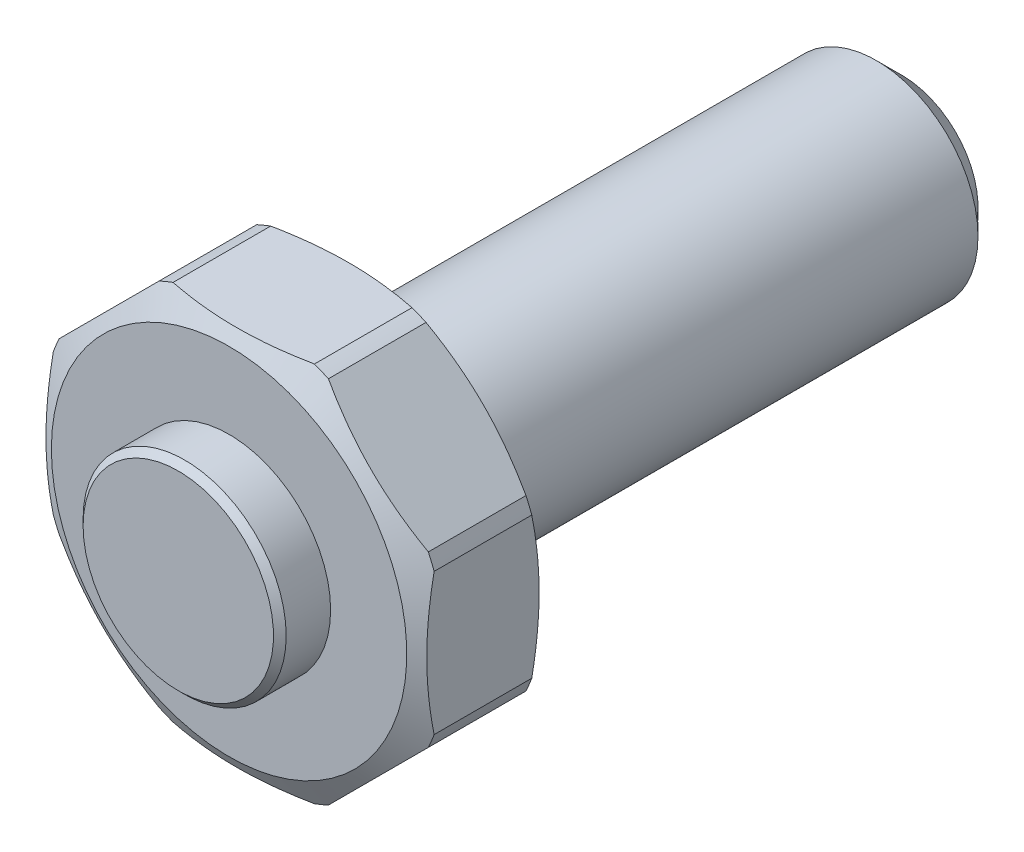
ISO-10303-21;
HEADER;
FILE_DESCRIPTION(('STEP AP214'),'2;1');
FILE_NAME('part.step','',(''),(''),'','','');
FILE_SCHEMA(('AUTOMOTIVE_DESIGN { 1 0 10303 214 1 1 1 1 }'));
ENDSEC;
DATA;
#1=APPLICATION_CONTEXT('core data for automotive mechanical design processes');
#2=APPLICATION_PROTOCOL_DEFINITION('international standard','automotive_design',2000,#1);
#3=PRODUCT_CONTEXT('',#1,'mechanical');
#4=PRODUCT('Part','Part','',(#3));
#5=PRODUCT_RELATED_PRODUCT_CATEGORY('part','',(#4));
#6=PRODUCT_DEFINITION_FORMATION('','',#4);
#7=PRODUCT_DEFINITION_CONTEXT('part definition',#1,'design');
#8=PRODUCT_DEFINITION('design','',#6,#7);
#9=PRODUCT_DEFINITION_SHAPE('','',#8);
#10=(LENGTH_UNIT() NAMED_UNIT(*) SI_UNIT(.MILLI.,.METRE.));
#11=(NAMED_UNIT(*) PLANE_ANGLE_UNIT() SI_UNIT($,.RADIAN.));
#12=(NAMED_UNIT(*) SI_UNIT($,.STERADIAN.) SOLID_ANGLE_UNIT());
#13=UNCERTAINTY_MEASURE_WITH_UNIT(LENGTH_MEASURE(1.E-05),#10,'distance_accuracy_value','');
#14=(GEOMETRIC_REPRESENTATION_CONTEXT(3) GLOBAL_UNCERTAINTY_ASSIGNED_CONTEXT((#13)) GLOBAL_UNIT_ASSIGNED_CONTEXT((#10,
#11,#12)) REPRESENTATION_CONTEXT('',''));
#15=CARTESIAN_POINT('',(0.,0.,0.));
#16=DIRECTION('',(0.,0.,1.));
#17=DIRECTION('',(1.,0.,0.));
#18=AXIS2_PLACEMENT_3D('',#15,#16,#17);
#19=CARTESIAN_POINT('',(0.,0.,22.));
#20=DIRECTION('',(0.,0.,1.));
#21=DIRECTION('',(1.,0.,0.));
#22=AXIS2_PLACEMENT_3D('',#19,#20,#21);
#23=CYLINDRICAL_SURFACE('',#22,8.);
#24=CARTESIAN_POINT('',(0.,0.,-41.));
#25=DIRECTION('',(0.,0.,-1.));
#26=DIRECTION('',(-1.,0.,0.));
#27=AXIS2_PLACEMENT_3D('',#24,#25,#26);
#28=CIRCLE('',#27,8.);
#29=CARTESIAN_POINT('',(-8.,0.,-41.));
#30=VERTEX_POINT('',#29);
#31=EDGE_CURVE('E9',#30,#30,#28,.F.);
#32=ORIENTED_EDGE('',*,*,#31,.T.);
#33=EDGE_LOOP('',(#32));
#34=FACE_BOUND('',#33,.T.);
#35=CARTESIAN_POINT('',(0.,0.,0.));
#36=DIRECTION('',(0.,0.,1.));
#37=DIRECTION('',(1.,0.,0.));
#38=AXIS2_PLACEMENT_3D('',#35,#36,#37);
#39=CIRCLE('',#38,8.);
#40=CARTESIAN_POINT('',(8.,0.,0.));
#41=VERTEX_POINT('',#40);
#42=EDGE_CURVE('E193',#41,#41,#39,.T.);
#43=ORIENTED_EDGE('',*,*,#42,.F.);
#44=EDGE_LOOP('',(#43));
#45=FACE_BOUND('',#44,.T.);
#46=ADVANCED_FACE('F14',(#34,#45),#23,.T.);
#47=CARTESIAN_POINT('',(8.,0.,0.));
#48=DIRECTION('',(0.,0.,1.));
#49=DIRECTION('',(1.,0.,0.));
#50=AXIS2_PLACEMENT_3D('',#47,#48,#49);
#51=PLANE('',#50);
#52=ORIENTED_EDGE('',*,*,#42,.T.);
#53=EDGE_LOOP('',(#52));
#54=FACE_BOUND('',#53,.T.);
#55=CARTESIAN_POINT('',(0.,0.,0.));
#56=DIRECTION('',(0.,0.,-1.));
#57=DIRECTION('',(-1.,0.,0.));
#58=AXIS2_PLACEMENT_3D('',#55,#56,#57);
#59=CIRCLE('',#58,14.);
#60=CARTESIAN_POINT('',(-14.,0.,0.));
#61=VERTEX_POINT('',#60);
#62=EDGE_CURVE('E369',#61,#61,#59,.T.);
#63=ORIENTED_EDGE('',*,*,#62,.T.);
#64=EDGE_LOOP('',(#63));
#65=FACE_BOUND('',#64,.T.);
#66=ADVANCED_FACE('F317',(#54,#65),#51,.F.);
#67=CARTESIAN_POINT('',(0.,0.,-58.));
#68=DIRECTION('',(0.,0.,-1.));
#69=DIRECTION('',(-1.,0.,0.));
#70=AXIS2_PLACEMENT_3D('',#67,#68,#69);
#71=CYLINDRICAL_SURFACE('',#70,16.);
#72=CARTESIAN_POINT('',(0.,0.,8.84529946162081));
#73=DIRECTION('',(0.,0.,-1.));
#74=DIRECTION('',(-1.,0.,0.));
#75=AXIS2_PLACEMENT_3D('',#72,#73,#74);
#76=CIRCLE('',#75,16.);
#77=CARTESIAN_POINT('',(5.56776436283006,-15.,8.84529946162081));
#78=VERTEX_POINT('',#77);
#79=CARTESIAN_POINT('',(6.66959778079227,-14.5436056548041,8.84529946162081));
#80=VERTEX_POINT('',#79);
#81=EDGE_CURVE('E482',#78,#80,#76,.F.);
#82=ORIENTED_EDGE('',*,*,#81,.F.);
#83=DIRECTION('',(0.,0.,-1.));
#84=VECTOR('',#83,1.);
#85=CARTESIAN_POINT('',(5.56776436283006,-15.,-58.));
#86=LINE('',#85,#84);
#87=CARTESIAN_POINT('',(5.56776436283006,-15.,1.1547005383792));
#88=VERTEX_POINT('',#87);
#89=EDGE_CURVE('E486',#78,#88,#86,.T.);
#90=ORIENTED_EDGE('',*,*,#89,.T.);
#91=CARTESIAN_POINT('',(0.,0.,1.1547005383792));
#92=DIRECTION('',(0.,0.,1.));
#93=DIRECTION('',(1.,0.,0.));
#94=AXIS2_PLACEMENT_3D('',#91,#92,#93);
#95=CIRCLE('',#94,16.);
#96=CARTESIAN_POINT('',(6.66959778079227,-14.5436056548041,1.1547005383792));
#97=VERTEX_POINT('',#96);
#98=EDGE_CURVE('E366',#97,#88,#95,.F.);
#99=ORIENTED_EDGE('',*,*,#98,.F.);
#100=DIRECTION('',(0.,0.,-1.));
#101=VECTOR('',#100,1.);
#102=CARTESIAN_POINT('',(6.66959778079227,-14.5436056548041,-58.));
#103=LINE('',#102,#101);
#104=EDGE_CURVE('E187',#80,#97,#103,.T.);
#105=ORIENTED_EDGE('',*,*,#104,.F.);
#106=EDGE_LOOP('',(#82,#90,#99,#105));
#107=FACE_BOUND('',#106,.T.);
#108=ADVANCED_FACE('F313',(#107),#71,.T.);
#109=CARTESIAN_POINT('',(15.,-5.56776436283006,1.1547005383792));
#110=VERTEX_POINT('',#109);
#111=CARTESIAN_POINT('',(14.5436056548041,-6.66959778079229,1.1547005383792));
#112=VERTEX_POINT('',#111);
#113=EDGE_CURVE('E29',#110,#112,#95,.F.);
#114=ORIENTED_EDGE('',*,*,#113,.F.);
#115=DIRECTION('',(0.,0.,-1.));
#116=VECTOR('',#115,1.);
#117=CARTESIAN_POINT('',(15.,-5.56776436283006,-58.));
#118=LINE('',#117,#116);
#119=CARTESIAN_POINT('',(15.,-5.56776436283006,8.84529946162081));
#120=VERTEX_POINT('',#119);
#121=EDGE_CURVE('E181',#120,#110,#118,.T.);
#122=ORIENTED_EDGE('',*,*,#121,.F.);
#123=CARTESIAN_POINT('',(14.5436056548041,-6.66959778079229,8.84529946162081));
#124=VERTEX_POINT('',#123);
#125=EDGE_CURVE('E476',#124,#120,#76,.F.);
#126=ORIENTED_EDGE('',*,*,#125,.F.);
#127=DIRECTION('',(0.,0.,-1.));
#128=VECTOR('',#127,1.);
#129=CARTESIAN_POINT('',(14.5436056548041,-6.66959778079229,-58.));
#130=LINE('',#129,#128);
#131=EDGE_CURVE('E184',#112,#124,#130,.F.);
#132=ORIENTED_EDGE('',*,*,#131,.F.);
#133=EDGE_LOOP('',(#114,#122,#126,#132));
#134=FACE_BOUND('',#133,.T.);
#135=ADVANCED_FACE('F316',(#134),#71,.T.);
#136=CARTESIAN_POINT('',(14.5436056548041,6.66959778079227,1.1547005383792));
#137=VERTEX_POINT('',#136);
#138=CARTESIAN_POINT('',(15.,5.56776436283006,1.1547005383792));
#139=VERTEX_POINT('',#138);
#140=EDGE_CURVE('E35',#137,#139,#95,.F.);
#141=ORIENTED_EDGE('',*,*,#140,.F.);
#142=DIRECTION('',(0.,0.,-1.));
#143=VECTOR('',#142,1.);
#144=CARTESIAN_POINT('',(14.5436056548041,6.66959778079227,-58.));
#145=LINE('',#144,#143);
#146=CARTESIAN_POINT('',(14.5436056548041,6.66959778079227,8.84529946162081));
#147=VERTEX_POINT('',#146);
#148=EDGE_CURVE('E175',#147,#137,#145,.T.);
#149=ORIENTED_EDGE('',*,*,#148,.F.);
#150=CARTESIAN_POINT('',(15.,5.56776436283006,8.84529946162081));
#151=VERTEX_POINT('',#150);
#152=EDGE_CURVE('E419',#151,#147,#76,.F.);
#153=ORIENTED_EDGE('',*,*,#152,.F.);
#154=DIRECTION('',(0.,0.,-1.));
#155=VECTOR('',#154,1.);
#156=CARTESIAN_POINT('',(15.,5.56776436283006,-58.));
#157=LINE('',#156,#155);
#158=EDGE_CURVE('E178',#139,#151,#157,.F.);
#159=ORIENTED_EDGE('',*,*,#158,.F.);
#160=EDGE_LOOP('',(#141,#149,#153,#159));
#161=FACE_BOUND('',#160,.T.);
#162=ADVANCED_FACE('F325',(#161),#71,.T.);
#163=CARTESIAN_POINT('',(5.56776436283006,15.,1.1547005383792));
#164=VERTEX_POINT('',#163);
#165=CARTESIAN_POINT('',(6.66959778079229,14.5436056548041,1.1547005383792));
#166=VERTEX_POINT('',#165);
#167=EDGE_CURVE('E440',#164,#166,#95,.F.);
#168=ORIENTED_EDGE('',*,*,#167,.F.);
#169=DIRECTION('',(0.,0.,-1.));
#170=VECTOR('',#169,1.);
#171=CARTESIAN_POINT('',(5.56776436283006,15.,-58.));
#172=LINE('',#171,#170);
#173=CARTESIAN_POINT('',(5.56776436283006,15.,8.84529946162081));
#174=VERTEX_POINT('',#173);
#175=EDGE_CURVE('E169',#174,#164,#172,.T.);
#176=ORIENTED_EDGE('',*,*,#175,.F.);
#177=CARTESIAN_POINT('',(6.66959778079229,14.5436056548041,8.84529946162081));
#178=VERTEX_POINT('',#177);
#179=EDGE_CURVE('E417',#178,#174,#76,.F.);
#180=ORIENTED_EDGE('',*,*,#179,.F.);
#181=DIRECTION('',(0.,0.,-1.));
#182=VECTOR('',#181,1.);
#183=CARTESIAN_POINT('',(6.66959778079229,14.5436056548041,-58.));
#184=LINE('',#183,#182);
#185=EDGE_CURVE('E172',#166,#178,#184,.F.);
#186=ORIENTED_EDGE('',*,*,#185,.F.);
#187=EDGE_LOOP('',(#168,#176,#180,#186));
#188=FACE_BOUND('',#187,.T.);
#189=ADVANCED_FACE('F424',(#188),#71,.T.);
#190=CARTESIAN_POINT('',(-6.66959778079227,14.5436056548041,1.1547005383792));
#191=VERTEX_POINT('',#190);
#192=CARTESIAN_POINT('',(-5.56776436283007,15.,1.1547005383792));
#193=VERTEX_POINT('',#192);
#194=EDGE_CURVE('E437',#191,#193,#95,.F.);
#195=ORIENTED_EDGE('',*,*,#194,.F.);
#196=DIRECTION('',(0.,0.,-1.));
#197=VECTOR('',#196,1.);
#198=CARTESIAN_POINT('',(-6.66959778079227,14.5436056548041,-58.));
#199=LINE('',#198,#197);
#200=CARTESIAN_POINT('',(-6.66959778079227,14.5436056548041,8.84529946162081));
#201=VERTEX_POINT('',#200);
#202=EDGE_CURVE('E158',#201,#191,#199,.T.);
#203=ORIENTED_EDGE('',*,*,#202,.F.);
#204=CARTESIAN_POINT('',(-5.56776436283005,15.,8.84529946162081));
#205=VERTEX_POINT('',#204);
#206=EDGE_CURVE('E365',#205,#201,#76,.F.);
#207=ORIENTED_EDGE('',*,*,#206,.F.);
#208=DIRECTION('',(0.,0.,-1.));
#209=VECTOR('',#208,1.);
#210=CARTESIAN_POINT('',(-5.56776436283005,15.,-58.));
#211=LINE('',#210,#209);
#212=EDGE_CURVE('E166',#193,#205,#211,.F.);
#213=ORIENTED_EDGE('',*,*,#212,.F.);
#214=EDGE_LOOP('',(#195,#203,#207,#213));
#215=FACE_BOUND('',#214,.T.);
#216=ADVANCED_FACE('F447',(#215),#71,.T.);
#217=DIRECTION('',(0.,0.,-1.));
#218=VECTOR('',#217,1.);
#219=CARTESIAN_POINT('',(-15.,-5.56776436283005,-58.));
#220=LINE('',#219,#218);
#221=CARTESIAN_POINT('',(-15.,-5.56776436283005,8.84529946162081));
#222=VERTEX_POINT('',#221);
#223=CARTESIAN_POINT('',(-15.,-5.56776436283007,1.1547005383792));
#224=VERTEX_POINT('',#223);
#225=EDGE_CURVE('E145',#222,#224,#220,.T.);
#226=ORIENTED_EDGE('',*,*,#225,.T.);
#227=CARTESIAN_POINT('',(-14.5436056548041,-6.66959778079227,1.1547005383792));
#228=VERTEX_POINT('',#227);
#229=EDGE_CURVE('E433',#228,#224,#95,.F.);
#230=ORIENTED_EDGE('',*,*,#229,.F.);
#231=DIRECTION('',(0.,0.,-1.));
#232=VECTOR('',#231,1.);
#233=CARTESIAN_POINT('',(-14.5436056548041,-6.66959778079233,-58.));
#234=LINE('',#233,#232);
#235=CARTESIAN_POINT('',(-14.5436056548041,-6.66959778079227,8.84529946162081));
#236=VERTEX_POINT('',#235);
#237=EDGE_CURVE('E148',#228,#236,#234,.F.);
#238=ORIENTED_EDGE('',*,*,#237,.T.);
#239=EDGE_CURVE('E131',#222,#236,#76,.F.);
#240=ORIENTED_EDGE('',*,*,#239,.F.);
#241=EDGE_LOOP('',(#226,#230,#238,#240));
#242=FACE_BOUND('',#241,.T.);
#243=ADVANCED_FACE('F143',(#242),#71,.T.);
#244=CARTESIAN_POINT('',(-15.,5.56776436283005,1.1547005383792));
#245=VERTEX_POINT('',#244);
#246=CARTESIAN_POINT('',(-14.5436056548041,6.66959778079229,1.1547005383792));
#247=VERTEX_POINT('',#246);
#248=EDGE_CURVE('E436',#245,#247,#95,.F.);
#249=ORIENTED_EDGE('',*,*,#248,.F.);
#250=DIRECTION('',(0.,0.,-1.));
#251=VECTOR('',#250,1.);
#252=CARTESIAN_POINT('',(-15.,5.56776436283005,-58.));
#253=LINE('',#252,#251);
#254=CARTESIAN_POINT('',(-15.,5.56776436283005,8.84529946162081));
#255=VERTEX_POINT('',#254);
#256=EDGE_CURVE('E155',#245,#255,#253,.F.);
#257=ORIENTED_EDGE('',*,*,#256,.T.);
#258=CARTESIAN_POINT('',(-14.5436056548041,6.66959778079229,8.84529946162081));
#259=VERTEX_POINT('',#258);
#260=EDGE_CURVE('E134',#259,#255,#76,.F.);
#261=ORIENTED_EDGE('',*,*,#260,.F.);
#262=DIRECTION('',(0.,0.,-1.));
#263=VECTOR('',#262,1.);
#264=CARTESIAN_POINT('',(-14.5436056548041,6.66959778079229,-58.));
#265=LINE('',#264,#263);
#266=EDGE_CURVE('E154',#247,#259,#265,.F.);
#267=ORIENTED_EDGE('',*,*,#266,.F.);
#268=EDGE_LOOP('',(#249,#257,#261,#267));
#269=FACE_BOUND('',#268,.T.);
#270=ADVANCED_FACE('F331',(#269),#71,.T.);
#271=DIRECTION('',(0.,0.,-1.));
#272=VECTOR('',#271,1.);
#273=CARTESIAN_POINT('',(-6.66959778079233,-14.5436056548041,-58.));
#274=LINE('',#273,#272);
#275=CARTESIAN_POINT('',(-6.66959778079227,-14.5436056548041,8.84529946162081));
#276=VERTEX_POINT('',#275);
#277=CARTESIAN_POINT('',(-6.66959778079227,-14.5436056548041,1.1547005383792));
#278=VERTEX_POINT('',#277);
#279=EDGE_CURVE('E160',#276,#278,#274,.T.);
#280=ORIENTED_EDGE('',*,*,#279,.T.);
#281=CARTESIAN_POINT('',(-5.56776436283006,-15.,1.1547005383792));
#282=VERTEX_POINT('',#281);
#283=EDGE_CURVE('E435',#282,#278,#95,.F.);
#284=ORIENTED_EDGE('',*,*,#283,.F.);
#285=DIRECTION('',(0.,0.,-1.));
#286=VECTOR('',#285,1.);
#287=CARTESIAN_POINT('',(-5.56776436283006,-15.,-58.));
#288=LINE('',#287,#286);
#289=CARTESIAN_POINT('',(-5.56776436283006,-15.,8.84529946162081));
#290=VERTEX_POINT('',#289);
#291=EDGE_CURVE('E211',#282,#290,#288,.F.);
#292=ORIENTED_EDGE('',*,*,#291,.T.);
#293=EDGE_CURVE('E150',#276,#290,#76,.F.);
#294=ORIENTED_EDGE('',*,*,#293,.F.);
#295=EDGE_LOOP('',(#280,#284,#292,#294));
#296=FACE_BOUND('',#295,.T.);
#297=ADVANCED_FACE('F222',(#296),#71,.T.);
#298=CARTESIAN_POINT('',(0.,0.,1.2741428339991));
#299=DIRECTION('',(0.,0.,1.));
#300=DIRECTION('',(1.,0.,0.));
#301=AXIS2_PLACEMENT_3D('',#298,#299,#300);
#302=CONICAL_SURFACE('',#301,16.2068801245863,1.0471975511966);
#303=CARTESIAN_POINT('',(14.5443095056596,-6.6688939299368,1.1549005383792));
#304=CARTESIAN_POINT('',(14.2907573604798,-6.92244607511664,1.08282477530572));
#305=CARTESIAN_POINT('',(14.0363374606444,-7.17686597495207,1.01666218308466));
#306=CARTESIAN_POINT('',(13.5259358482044,-7.68726758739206,0.897181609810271));
#307=CARTESIAN_POINT('',(13.2699537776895,-7.94324965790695,0.843866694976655));
#308=CARTESIAN_POINT('',(12.7566071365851,-8.45659629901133,0.75111422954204));
#309=CARTESIAN_POINT('',(12.4992419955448,-8.71396144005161,0.711682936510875));
#310=CARTESIAN_POINT('',(11.9836133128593,-9.22959012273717,0.647551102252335));
#311=CARTESIAN_POINT('',(11.7253498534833,-9.48785358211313,0.622849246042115));
#312=CARTESIAN_POINT('',(11.2123611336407,-10.0008423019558,0.588989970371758));
#313=CARTESIAN_POINT('',(10.9576437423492,-10.2555596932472,0.579595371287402));
#314=CARTESIAN_POINT('',(10.4481406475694,-10.765062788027,0.575818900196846));
#315=CARTESIAN_POINT('',(10.1933549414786,-11.0198484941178,0.581437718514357));
#316=CARTESIAN_POINT('',(9.68431863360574,-11.5288848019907,0.607555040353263));
#317=CARTESIAN_POINT('',(9.43006780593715,-11.7831356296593,0.628044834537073));
#318=CARTESIAN_POINT('',(8.9223780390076,-12.2908253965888,0.683445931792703));
#319=CARTESIAN_POINT('',(8.66893902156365,-12.5442644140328,0.71835580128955));
#320=CARTESIAN_POINT('',(8.26991529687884,-12.9432881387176,0.784248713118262));
#321=CARTESIAN_POINT('',(8.12394484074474,-13.0892585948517,0.810673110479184));
#322=CARTESIAN_POINT('',(7.83245226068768,-13.3807511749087,0.867921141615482));
#323=CARTESIAN_POINT('',(7.68693008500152,-13.5262733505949,0.898744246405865));
#324=CARTESIAN_POINT('',(7.39568681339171,-13.8175166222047,0.964759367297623));
#325=CARTESIAN_POINT('',(7.24996796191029,-13.9632354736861,0.999971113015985));
#326=CARTESIAN_POINT('',(6.95903868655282,-14.2541647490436,1.07444745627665));
#327=CARTESIAN_POINT('',(6.8138282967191,-14.3993751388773,1.11371232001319));
#328=CARTESIAN_POINT('',(6.66889392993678,-14.5443095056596,1.1549005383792));
#329=B_SPLINE_CURVE_WITH_KNOTS('',3,(#303,#304,#305,#306,#307,#308,#309,#310,#311,#312,#313,
#314,#315,#316,#317,#318,#319,#320,#321,#322,#323,#324,#325,#326,#327,#328),.UNSPECIFIED.,.F.,
.F.,(4,2,2,2,2,2,2,2,2,2,2,2,4),(0.,1.09725360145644,2.19476881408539,3.2927780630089,
4.39068927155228,5.4714212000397,6.55220282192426,7.6323519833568,8.71239378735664,
9.33670545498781,9.96094210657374,10.5880937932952,11.2152866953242),.UNSPECIFIED.);
#330=EDGE_CURVE('E275',#112,#97,#329,.T.);
#331=ORIENTED_EDGE('',*,*,#330,.T.);
#332=ORIENTED_EDGE('',*,*,#98,.T.);
#333=CARTESIAN_POINT('',(-18.7182965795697,-15.,5.76597857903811));
#334=CARTESIAN_POINT('',(-18.4338852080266,-15.,5.63784396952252));
#335=CARTESIAN_POINT('',(-18.1490489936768,-15.,5.51065308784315));
#336=CARTESIAN_POINT('',(-17.57844667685,-15.,5.25836161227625));
#337=CARTESIAN_POINT('',(-17.2926805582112,-15.,5.13326105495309));
#338=CARTESIAN_POINT('',(-16.4337525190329,-15.,4.7613497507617));
#339=CARTESIAN_POINT('',(-15.8590894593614,-15.,4.51798750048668));
#340=CARTESIAN_POINT('',(-14.7016882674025,-15.,4.04109882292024));
#341=CARTESIAN_POINT('',(-14.11892244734,-15.,3.80763938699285));
#342=CARTESIAN_POINT('',(-12.9479737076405,-15.,3.35476823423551));
#343=CARTESIAN_POINT('',(-12.3597911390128,-15.,3.13535561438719));
#344=CARTESIAN_POINT('',(-11.1833470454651,-15.,2.71609774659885));
#345=CARTESIAN_POINT('',(-10.5951499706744,-15.,2.51607271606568));
#346=CARTESIAN_POINT('',(-9.41191530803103,-15.,2.13704271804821));
#347=CARTESIAN_POINT('',(-8.81687721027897,-15.,1.95803932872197));
#348=CARTESIAN_POINT('',(-7.6208901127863,-15.,1.62626024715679));
#349=CARTESIAN_POINT('',(-7.01995712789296,-15.,1.47342733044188));
#350=CARTESIAN_POINT('',(-5.81102244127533,-15.,1.19897131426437));
#351=CARTESIAN_POINT('',(-5.20302250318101,-15.,1.07734059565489));
#352=CARTESIAN_POINT('',(-4.24104375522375,-15.,0.914758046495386));
#353=CARTESIAN_POINT('',(-3.88912344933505,-15.,0.86150434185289));
#354=CARTESIAN_POINT('',(-3.18356517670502,-15.,0.768033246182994));
#355=CARTESIAN_POINT('',(-2.82992734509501,-15.,0.72781484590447));
#356=CARTESIAN_POINT('',(-2.12129042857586,-15.,0.661192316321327));
#357=CARTESIAN_POINT('',(-1.76629113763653,-15.,0.634790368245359));
#358=CARTESIAN_POINT('',(-1.05550709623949,-15.,0.596361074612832));
#359=CARTESIAN_POINT('',(-0.699722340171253,-15.,0.584333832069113));
#360=CARTESIAN_POINT('',(0.0123500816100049,-15.,0.574912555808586));
#361=CARTESIAN_POINT('',(0.368637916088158,-15.,0.577531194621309));
#362=CARTESIAN_POINT('',(1.08080070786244,-15.,0.597373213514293));
#363=CARTESIAN_POINT('',(1.43667566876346,-15.,0.614596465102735));
#364=CARTESIAN_POINT('',(2.14733127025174,-15.,0.663268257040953));
#365=CARTESIAN_POINT('',(2.50211222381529,-15.,0.694712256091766));
#366=CARTESIAN_POINT('',(3.2102307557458,-15.,0.771183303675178));
#367=CARTESIAN_POINT('',(3.56356819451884,-15.,0.816211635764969));
#368=CARTESIAN_POINT('',(4.28565395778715,-15.,0.92151872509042));
#369=CARTESIAN_POINT('',(4.65430875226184,-15.,0.982436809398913));
#370=CARTESIAN_POINT('',(5.38927148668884,-15.,1.11714646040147));
#371=CARTESIAN_POINT('',(5.75557920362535,-15.,1.190939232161));
#372=CARTESIAN_POINT('',(6.85091671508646,-15.,1.42985571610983));
#373=CARTESIAN_POINT('',(7.57615630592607,-15.,1.61248648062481));
#374=CARTESIAN_POINT('',(9.01882617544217,-15.,2.0155891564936));
#375=CARTESIAN_POINT('',(9.73621549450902,-15.,2.23620444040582));
#376=CARTESIAN_POINT('',(11.1612204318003,-15.,2.70646047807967));
#377=CARTESIAN_POINT('',(11.8688373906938,-15.,2.95609720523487));
#378=CARTESIAN_POINT('',(13.2842994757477,-15.,3.48104677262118));
#379=CARTESIAN_POINT('',(13.9920407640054,-15.,3.75663719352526));
#380=CARTESIAN_POINT('',(15.4003441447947,-15.,4.32566372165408));
#381=CARTESIAN_POINT('',(16.1009056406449,-15.,4.61910129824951));
#382=CARTESIAN_POINT('',(17.1438365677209,-15.,5.06824921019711));
#383=CARTESIAN_POINT('',(17.4884869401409,-15.,5.21870269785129));
#384=CARTESIAN_POINT('',(18.1764436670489,-15.,5.52265904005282));
#385=CARTESIAN_POINT('',(18.5197500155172,-15.,5.67616190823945));
#386=CARTESIAN_POINT('',(19.2050331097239,-15.,5.98582997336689));
#387=CARTESIAN_POINT('',(19.5470102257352,-15.,6.14199435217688));
#388=CARTESIAN_POINT('',(20.2298395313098,-15.,6.45674675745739));
#389=CARTESIAN_POINT('',(20.5706917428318,-15.,6.6153347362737));
#390=CARTESIAN_POINT('',(20.9110384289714,-15.,6.7749956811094));
#391=B_SPLINE_CURVE_WITH_KNOTS('',3,(#333,#334,#335,#336,#337,#338,#339,#340,#341,#342,#343,
#344,#345,#346,#347,#348,#349,#350,#351,#352,#353,#354,#355,#356,#357,#358,#359,#360,#361,#362,
#363,#364,#365,#366,#367,#368,#369,#370,#371,#372,#373,#374,#375,#376,#377,#378,#379,#380,#381,
#382,#383,#384,#385,#386,#387,#388,#389,#390),.UNSPECIFIED.,.F.,.F.,(4,2,2,2,2,2,2,2,2,2,2,2,2,
2,2,2,2,2,2,2,2,2,2,2,2,2,2,2,4),(0.,0.935825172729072,1.87166669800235,3.74377293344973,
5.6269965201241,7.51009891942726,9.3736153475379,11.2372715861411,13.0967992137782,
14.9558723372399,16.0234445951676,17.0909341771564,18.1585922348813,19.2262579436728,
20.2948476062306,21.3634278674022,22.4316671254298,23.500007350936,24.6207129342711,
25.7415234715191,27.98376405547,30.2346613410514,32.4852466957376,34.7634603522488,
37.0418618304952,38.1700270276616,39.2981972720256,40.4260267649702,41.5538341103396),.UNSPECIFIED.);
#392=EDGE_CURVE('E202',#282,#88,#391,.T.);
#393=ORIENTED_EDGE('',*,*,#392,.F.);
#394=ORIENTED_EDGE('',*,*,#283,.T.);
#395=CARTESIAN_POINT('',(-14.5443095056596,-6.66889392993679,1.1549005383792));
#396=CARTESIAN_POINT('',(-14.2907573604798,-6.92244607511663,1.08282477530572));
#397=CARTESIAN_POINT('',(-14.0363374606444,-7.17686597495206,1.01666218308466));
#398=CARTESIAN_POINT('',(-13.5259358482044,-7.68726758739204,0.897181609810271));
#399=CARTESIAN_POINT('',(-13.2699537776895,-7.94324965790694,0.843866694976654));
#400=CARTESIAN_POINT('',(-12.7566071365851,-8.45659629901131,0.751114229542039));
#401=CARTESIAN_POINT('',(-12.4992419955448,-8.71396144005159,0.711682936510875));
#402=CARTESIAN_POINT('',(-11.9836133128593,-9.22959012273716,0.647551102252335));
#403=CARTESIAN_POINT('',(-11.7253498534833,-9.48785358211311,0.622849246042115));
#404=CARTESIAN_POINT('',(-11.2123611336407,-10.0008423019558,0.588989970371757));
#405=CARTESIAN_POINT('',(-10.9576437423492,-10.2555596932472,0.579595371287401));
#406=CARTESIAN_POINT('',(-10.4481406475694,-10.765062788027,0.575818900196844));
#407=CARTESIAN_POINT('',(-10.1933549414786,-11.0198484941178,0.581437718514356));
#408=CARTESIAN_POINT('',(-9.68431863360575,-11.5288848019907,0.607555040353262));
#409=CARTESIAN_POINT('',(-9.43006780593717,-11.7831356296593,0.628044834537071));
#410=CARTESIAN_POINT('',(-8.92237803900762,-12.2908253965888,0.683445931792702));
#411=CARTESIAN_POINT('',(-8.66893902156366,-12.5442644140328,0.718355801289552));
#412=CARTESIAN_POINT('',(-8.26991529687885,-12.9432881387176,0.784248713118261));
#413=CARTESIAN_POINT('',(-8.12394484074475,-13.0892585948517,0.810673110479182));
#414=CARTESIAN_POINT('',(-7.83245226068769,-13.3807511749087,0.867921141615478));
#415=CARTESIAN_POINT('',(-7.68693008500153,-13.5262733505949,0.898744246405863));
#416=CARTESIAN_POINT('',(-7.39568681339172,-13.8175166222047,0.964759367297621));
#417=CARTESIAN_POINT('',(-7.24996796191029,-13.9632354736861,0.999971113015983));
#418=CARTESIAN_POINT('',(-6.95903868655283,-14.2541647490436,1.07444745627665));
#419=CARTESIAN_POINT('',(-6.81382829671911,-14.3993751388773,1.11371232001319));
#420=CARTESIAN_POINT('',(-6.66889392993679,-14.5443095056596,1.1549005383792));
#421=B_SPLINE_CURVE_WITH_KNOTS('',3,(#395,#396,#397,#398,#399,#400,#401,#402,#403,#404,#405,
#406,#407,#408,#409,#410,#411,#412,#413,#414,#415,#416,#417,#418,#419,#420),.UNSPECIFIED.,.F.,
.F.,(4,2,2,2,2,2,2,2,2,2,2,2,4),(0.,1.09725360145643,2.19476881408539,3.2927780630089,
4.39068927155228,5.4714212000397,6.55220282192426,7.6323519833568,8.71239378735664,
9.33670545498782,9.96094210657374,10.5880937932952,11.2152866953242),.UNSPECIFIED.);
#422=EDGE_CURVE('E232',#228,#278,#421,.T.);
#423=ORIENTED_EDGE('',*,*,#422,.F.);
#424=ORIENTED_EDGE('',*,*,#229,.T.);
#425=CARTESIAN_POINT('',(-15.,-18.7182965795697,5.76597857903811));
#426=CARTESIAN_POINT('',(-15.,-18.4338852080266,5.63784396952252));
#427=CARTESIAN_POINT('',(-15.,-18.1490489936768,5.51065308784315));
#428=CARTESIAN_POINT('',(-15.,-17.57844667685,5.25836161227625));
#429=CARTESIAN_POINT('',(-15.,-17.2926805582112,5.13326105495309));
#430=CARTESIAN_POINT('',(-15.,-16.4337525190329,4.7613497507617));
#431=CARTESIAN_POINT('',(-15.,-15.8590894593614,4.51798750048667));
#432=CARTESIAN_POINT('',(-15.,-14.7016882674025,4.04109882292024));
#433=CARTESIAN_POINT('',(-15.,-14.11892244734,3.80763938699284));
#434=CARTESIAN_POINT('',(-15.,-12.9479737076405,3.35476823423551));
#435=CARTESIAN_POINT('',(-15.,-12.3597911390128,3.13535561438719));
#436=CARTESIAN_POINT('',(-15.,-11.1833470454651,2.71609774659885));
#437=CARTESIAN_POINT('',(-15.,-10.5951499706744,2.51607271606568));
#438=CARTESIAN_POINT('',(-15.,-9.41191530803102,2.1370427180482));
#439=CARTESIAN_POINT('',(-15.,-8.81687721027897,1.95803932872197));
#440=CARTESIAN_POINT('',(-15.,-7.6208901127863,1.62626024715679));
#441=CARTESIAN_POINT('',(-15.,-7.01995712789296,1.47342733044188));
#442=CARTESIAN_POINT('',(-15.,-5.81102244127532,1.19897131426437));
#443=CARTESIAN_POINT('',(-15.,-5.20302250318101,1.07734059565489));
#444=CARTESIAN_POINT('',(-15.,-4.24104375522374,0.914758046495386));
#445=CARTESIAN_POINT('',(-15.,-3.88912344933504,0.86150434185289));
#446=CARTESIAN_POINT('',(-15.,-3.18356517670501,0.768033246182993));
#447=CARTESIAN_POINT('',(-15.,-2.829927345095,0.727814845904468));
#448=CARTESIAN_POINT('',(-15.,-2.12129042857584,0.661192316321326));
#449=CARTESIAN_POINT('',(-15.,-1.76629113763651,0.634790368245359));
#450=CARTESIAN_POINT('',(-15.,-1.05550709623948,0.596361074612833));
#451=CARTESIAN_POINT('',(-15.,-0.699722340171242,0.584333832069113));
#452=CARTESIAN_POINT('',(-15.,0.0123500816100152,0.574912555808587));
#453=CARTESIAN_POINT('',(-15.,0.368637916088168,0.57753119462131));
#454=CARTESIAN_POINT('',(-15.,1.08080070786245,0.597373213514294));
#455=CARTESIAN_POINT('',(-15.,1.43667566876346,0.614596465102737));
#456=CARTESIAN_POINT('',(-15.,2.14733127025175,0.663268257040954));
#457=CARTESIAN_POINT('',(-15.,2.5021122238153,0.694712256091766));
#458=CARTESIAN_POINT('',(-15.,3.2102307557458,0.771183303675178));
#459=CARTESIAN_POINT('',(-15.,3.56356819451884,0.816211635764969));
#460=CARTESIAN_POINT('',(-15.,4.28565395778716,0.92151872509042));
#461=CARTESIAN_POINT('',(-15.,4.65430875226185,0.982436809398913));
#462=CARTESIAN_POINT('',(-15.,5.38927148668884,1.11714646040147));
#463=CARTESIAN_POINT('',(-15.,5.75557920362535,1.190939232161));
#464=CARTESIAN_POINT('',(-15.,6.85091671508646,1.42985571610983));
#465=CARTESIAN_POINT('',(-15.,7.57615630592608,1.61248648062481));
#466=CARTESIAN_POINT('',(-15.,9.01882617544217,2.0155891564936));
#467=CARTESIAN_POINT('',(-15.,9.73621549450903,2.23620444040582));
#468=CARTESIAN_POINT('',(-15.,11.1612204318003,2.70646047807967));
#469=CARTESIAN_POINT('',(-15.,11.8688373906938,2.95609720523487));
#470=CARTESIAN_POINT('',(-15.,13.2842994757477,3.48104677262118));
#471=CARTESIAN_POINT('',(-15.,13.9920407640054,3.75663719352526));
#472=CARTESIAN_POINT('',(-15.,15.4003441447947,4.32566372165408));
#473=CARTESIAN_POINT('',(-15.,16.1009056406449,4.61910129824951));
#474=CARTESIAN_POINT('',(-15.,17.1438365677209,5.06824921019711));
#475=CARTESIAN_POINT('',(-15.,17.4884869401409,5.21870269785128));
#476=CARTESIAN_POINT('',(-15.,18.1764436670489,5.52265904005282));
#477=CARTESIAN_POINT('',(-15.,18.5197500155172,5.67616190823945));
#478=CARTESIAN_POINT('',(-15.,19.2050331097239,5.98582997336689));
#479=CARTESIAN_POINT('',(-15.,19.5470102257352,6.14199435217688));
#480=CARTESIAN_POINT('',(-15.,20.2298395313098,6.45674675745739));
#481=CARTESIAN_POINT('',(-15.,20.5706917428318,6.6153347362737));
#482=CARTESIAN_POINT('',(-15.,20.9110384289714,6.7749956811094));
#483=B_SPLINE_CURVE_WITH_KNOTS('',3,(#425,#426,#427,#428,#429,#430,#431,#432,#433,#434,#435,
#436,#437,#438,#439,#440,#441,#442,#443,#444,#445,#446,#447,#448,#449,#450,#451,#452,#453,#454,
#455,#456,#457,#458,#459,#460,#461,#462,#463,#464,#465,#466,#467,#468,#469,#470,#471,#472,#473,
#474,#475,#476,#477,#478,#479,#480,#481,#482),.UNSPECIFIED.,.F.,.F.,(4,2,2,2,2,2,2,2,2,2,2,2,2,
2,2,2,2,2,2,2,2,2,2,2,2,2,2,2,4),(0.,0.935825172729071,1.87166669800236,3.74377293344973,
5.62699652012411,7.51009891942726,9.37361534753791,11.2372715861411,13.0967992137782,
14.95587233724,16.0234445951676,17.0909341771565,18.1585922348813,19.2262579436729,
20.2948476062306,21.3634278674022,22.4316671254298,23.500007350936,24.6207129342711,
25.7415234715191,27.98376405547,30.2346613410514,32.4852466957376,34.7634603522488,
37.0418618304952,38.1700270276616,39.2981972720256,40.4260267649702,41.5538341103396),.UNSPECIFIED.);
#484=EDGE_CURVE('E153',#245,#224,#483,.F.);
#485=ORIENTED_EDGE('',*,*,#484,.F.);
#486=ORIENTED_EDGE('',*,*,#248,.T.);
#487=CARTESIAN_POINT('',(-14.5443095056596,6.6688939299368,1.1549005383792));
#488=CARTESIAN_POINT('',(-14.2907573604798,6.92244607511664,1.08282477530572));
#489=CARTESIAN_POINT('',(-14.0363374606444,7.17686597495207,1.01666218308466));
#490=CARTESIAN_POINT('',(-13.5259358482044,7.68726758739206,0.897181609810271));
#491=CARTESIAN_POINT('',(-13.2699537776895,7.94324965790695,0.843866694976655));
#492=CARTESIAN_POINT('',(-12.7566071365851,8.45659629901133,0.75111422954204));
#493=CARTESIAN_POINT('',(-12.4992419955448,8.71396144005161,0.711682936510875));
#494=CARTESIAN_POINT('',(-11.9836133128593,9.22959012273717,0.647551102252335));
#495=CARTESIAN_POINT('',(-11.7253498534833,9.48785358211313,0.622849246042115));
#496=CARTESIAN_POINT('',(-11.2123611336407,10.0008423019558,0.588989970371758));
#497=CARTESIAN_POINT('',(-10.9576437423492,10.2555596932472,0.579595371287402));
#498=CARTESIAN_POINT('',(-10.4481406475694,10.765062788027,0.575818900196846));
#499=CARTESIAN_POINT('',(-10.1933549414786,11.0198484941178,0.581437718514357));
#500=CARTESIAN_POINT('',(-9.68431863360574,11.5288848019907,0.607555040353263));
#501=CARTESIAN_POINT('',(-9.43006780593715,11.7831356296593,0.628044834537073));
#502=CARTESIAN_POINT('',(-8.9223780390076,12.2908253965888,0.683445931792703));
#503=CARTESIAN_POINT('',(-8.66893902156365,12.5442644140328,0.71835580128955));
#504=CARTESIAN_POINT('',(-8.26991529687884,12.9432881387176,0.784248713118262));
#505=CARTESIAN_POINT('',(-8.12394484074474,13.0892585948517,0.810673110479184));
#506=CARTESIAN_POINT('',(-7.83245226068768,13.3807511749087,0.867921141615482));
#507=CARTESIAN_POINT('',(-7.68693008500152,13.5262733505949,0.898744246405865));
#508=CARTESIAN_POINT('',(-7.39568681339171,13.8175166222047,0.964759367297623));
#509=CARTESIAN_POINT('',(-7.24996796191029,13.9632354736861,0.999971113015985));
#510=CARTESIAN_POINT('',(-6.95903868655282,14.2541647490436,1.07444745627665));
#511=CARTESIAN_POINT('',(-6.8138282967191,14.3993751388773,1.11371232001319));
#512=CARTESIAN_POINT('',(-6.66889392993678,14.5443095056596,1.1549005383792));
#513=B_SPLINE_CURVE_WITH_KNOTS('',3,(#487,#488,#489,#490,#491,#492,#493,#494,#495,#496,#497,
#498,#499,#500,#501,#502,#503,#504,#505,#506,#507,#508,#509,#510,#511,#512),.UNSPECIFIED.,.F.,
.F.,(4,2,2,2,2,2,2,2,2,2,2,2,4),(0.,1.09725360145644,2.19476881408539,3.2927780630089,
4.39068927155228,5.4714212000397,6.55220282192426,7.6323519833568,8.71239378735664,
9.33670545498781,9.96094210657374,10.5880937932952,11.2152866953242),.UNSPECIFIED.);
#514=EDGE_CURVE('E247',#247,#191,#513,.T.);
#515=ORIENTED_EDGE('',*,*,#514,.T.);
#516=ORIENTED_EDGE('',*,*,#194,.T.);
#517=CARTESIAN_POINT('',(-18.7182965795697,15.,5.76597857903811));
#518=CARTESIAN_POINT('',(-18.4338852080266,15.,5.63784396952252));
#519=CARTESIAN_POINT('',(-18.1490489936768,15.,5.51065308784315));
#520=CARTESIAN_POINT('',(-17.57844667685,15.,5.25836161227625));
#521=CARTESIAN_POINT('',(-17.2926805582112,15.,5.13326105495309));
#522=CARTESIAN_POINT('',(-16.4337525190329,15.,4.7613497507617));
#523=CARTESIAN_POINT('',(-15.8590894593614,15.,4.51798750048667));
#524=CARTESIAN_POINT('',(-14.7016882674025,15.,4.04109882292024));
#525=CARTESIAN_POINT('',(-14.11892244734,15.,3.80763938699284));
#526=CARTESIAN_POINT('',(-12.9479737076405,15.,3.35476823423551));
#527=CARTESIAN_POINT('',(-12.3597911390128,15.,3.13535561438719));
#528=CARTESIAN_POINT('',(-11.1833470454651,15.,2.71609774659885));
#529=CARTESIAN_POINT('',(-10.5951499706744,15.,2.51607271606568));
#530=CARTESIAN_POINT('',(-9.41191530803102,15.,2.1370427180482));
#531=CARTESIAN_POINT('',(-8.81687721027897,15.,1.95803932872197));
#532=CARTESIAN_POINT('',(-7.6208901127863,15.,1.62626024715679));
#533=CARTESIAN_POINT('',(-7.01995712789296,15.,1.47342733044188));
#534=CARTESIAN_POINT('',(-5.81102244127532,15.,1.19897131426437));
#535=CARTESIAN_POINT('',(-5.20302250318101,15.,1.07734059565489));
#536=CARTESIAN_POINT('',(-4.24104375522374,15.,0.914758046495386));
#537=CARTESIAN_POINT('',(-3.88912344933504,15.,0.861504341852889));
#538=CARTESIAN_POINT('',(-3.18356517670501,15.,0.768033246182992));
#539=CARTESIAN_POINT('',(-2.829927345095,15.,0.727814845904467));
#540=CARTESIAN_POINT('',(-2.12129042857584,15.,0.661192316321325));
#541=CARTESIAN_POINT('',(-1.76629113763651,15.,0.634790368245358));
#542=CARTESIAN_POINT('',(-1.05550709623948,15.,0.596361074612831));
#543=CARTESIAN_POINT('',(-0.699722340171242,15.,0.584333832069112));
#544=CARTESIAN_POINT('',(0.0123500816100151,15.,0.574912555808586));
#545=CARTESIAN_POINT('',(0.368637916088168,15.,0.577531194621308));
#546=CARTESIAN_POINT('',(1.08080070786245,15.,0.597373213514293));
#547=CARTESIAN_POINT('',(1.43667566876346,15.,0.614596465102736));
#548=CARTESIAN_POINT('',(2.14733127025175,15.,0.663268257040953));
#549=CARTESIAN_POINT('',(2.5021122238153,15.,0.694712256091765));
#550=CARTESIAN_POINT('',(3.2102307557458,15.,0.771183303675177));
#551=CARTESIAN_POINT('',(3.56356819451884,15.,0.816211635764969));
#552=CARTESIAN_POINT('',(4.28565395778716,15.,0.92151872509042));
#553=CARTESIAN_POINT('',(4.65430875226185,15.,0.982436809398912));
#554=CARTESIAN_POINT('',(5.38927148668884,15.,1.11714646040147));
#555=CARTESIAN_POINT('',(5.75557920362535,15.,1.190939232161));
#556=CARTESIAN_POINT('',(6.85091671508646,15.,1.42985571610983));
#557=CARTESIAN_POINT('',(7.57615630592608,15.,1.61248648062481));
#558=CARTESIAN_POINT('',(9.01882617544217,15.,2.0155891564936));
#559=CARTESIAN_POINT('',(9.73621549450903,15.,2.23620444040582));
#560=CARTESIAN_POINT('',(11.1612204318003,15.,2.70646047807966));
#561=CARTESIAN_POINT('',(11.8688373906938,15.,2.95609720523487));
#562=CARTESIAN_POINT('',(13.2842994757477,15.,3.48104677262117));
#563=CARTESIAN_POINT('',(13.9920407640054,15.,3.75663719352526));
#564=CARTESIAN_POINT('',(15.4003441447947,15.,4.32566372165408));
#565=CARTESIAN_POINT('',(16.1009056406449,15.,4.61910129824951));
#566=CARTESIAN_POINT('',(17.1438365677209,15.,5.06824921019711));
#567=CARTESIAN_POINT('',(17.4884869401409,15.,5.21870269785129));
#568=CARTESIAN_POINT('',(18.1764436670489,15.,5.52265904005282));
#569=CARTESIAN_POINT('',(18.5197500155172,15.,5.67616190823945));
#570=CARTESIAN_POINT('',(19.2050331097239,15.,5.98582997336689));
#571=CARTESIAN_POINT('',(19.5470102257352,15.,6.14199435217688));
#572=CARTESIAN_POINT('',(20.2298395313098,15.,6.4567467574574));
#573=CARTESIAN_POINT('',(20.5706917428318,15.,6.6153347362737));
#574=CARTESIAN_POINT('',(20.9110384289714,15.,6.7749956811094));
#575=B_SPLINE_CURVE_WITH_KNOTS('',3,(#517,#518,#519,#520,#521,#522,#523,#524,#525,#526,#527,
#528,#529,#530,#531,#532,#533,#534,#535,#536,#537,#538,#539,#540,#541,#542,#543,#544,#545,#546,
#547,#548,#549,#550,#551,#552,#553,#554,#555,#556,#557,#558,#559,#560,#561,#562,#563,#564,#565,
#566,#567,#568,#569,#570,#571,#572,#573,#574),.UNSPECIFIED.,.F.,.F.,(4,2,2,2,2,2,2,2,2,2,2,2,2,
2,2,2,2,2,2,2,2,2,2,2,2,2,2,2,4),(0.,0.935825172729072,1.87166669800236,3.74377293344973,
5.6269965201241,7.51009891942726,9.3736153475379,11.2372715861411,13.0967992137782,
14.95587233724,16.0234445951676,17.0909341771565,18.1585922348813,19.2262579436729,
20.2948476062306,21.3634278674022,22.4316671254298,23.500007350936,24.6207129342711,
25.7415234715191,27.98376405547,30.2346613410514,32.4852466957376,34.7634603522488,
37.0418618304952,38.1700270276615,39.2981972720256,40.4260267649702,41.5538341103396),.UNSPECIFIED.);
#576=EDGE_CURVE('E255',#193,#164,#575,.T.);
#577=ORIENTED_EDGE('',*,*,#576,.T.);
#578=ORIENTED_EDGE('',*,*,#167,.T.);
#579=CARTESIAN_POINT('',(6.6688939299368,14.5443095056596,1.1549005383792));
#580=CARTESIAN_POINT('',(6.92244607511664,14.2907573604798,1.08282477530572));
#581=CARTESIAN_POINT('',(7.17686597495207,14.0363374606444,1.01666218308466));
#582=CARTESIAN_POINT('',(7.68726758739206,13.5259358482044,0.897181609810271));
#583=CARTESIAN_POINT('',(7.94324965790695,13.2699537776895,0.843866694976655));
#584=CARTESIAN_POINT('',(8.45659629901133,12.7566071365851,0.75111422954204));
#585=CARTESIAN_POINT('',(8.71396144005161,12.4992419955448,0.711682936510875));
#586=CARTESIAN_POINT('',(9.22959012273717,11.9836133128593,0.647551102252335));
#587=CARTESIAN_POINT('',(9.48785358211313,11.7253498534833,0.622849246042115));
#588=CARTESIAN_POINT('',(10.0008423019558,11.2123611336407,0.588989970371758));
#589=CARTESIAN_POINT('',(10.2555596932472,10.9576437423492,0.579595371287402));
#590=CARTESIAN_POINT('',(10.765062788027,10.4481406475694,0.575818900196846));
#591=CARTESIAN_POINT('',(11.0198484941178,10.1933549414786,0.581437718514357));
#592=CARTESIAN_POINT('',(11.5288848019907,9.68431863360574,0.607555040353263));
#593=CARTESIAN_POINT('',(11.7831356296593,9.43006780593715,0.628044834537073));
#594=CARTESIAN_POINT('',(12.2908253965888,8.9223780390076,0.683445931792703));
#595=CARTESIAN_POINT('',(12.5442644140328,8.66893902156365,0.71835580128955));
#596=CARTESIAN_POINT('',(12.9432881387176,8.26991529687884,0.784248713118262));
#597=CARTESIAN_POINT('',(13.0892585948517,8.12394484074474,0.810673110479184));
#598=CARTESIAN_POINT('',(13.3807511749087,7.83245226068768,0.867921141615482));
#599=CARTESIAN_POINT('',(13.5262733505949,7.68693008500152,0.898744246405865));
#600=CARTESIAN_POINT('',(13.8175166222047,7.39568681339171,0.964759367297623));
#601=CARTESIAN_POINT('',(13.9632354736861,7.24996796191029,0.999971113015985));
#602=CARTESIAN_POINT('',(14.2541647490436,6.95903868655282,1.07444745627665));
#603=CARTESIAN_POINT('',(14.3993751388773,6.8138282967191,1.11371232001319));
#604=CARTESIAN_POINT('',(14.5443095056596,6.66889392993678,1.1549005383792));
#605=B_SPLINE_CURVE_WITH_KNOTS('',3,(#579,#580,#581,#582,#583,#584,#585,#586,#587,#588,#589,
#590,#591,#592,#593,#594,#595,#596,#597,#598,#599,#600,#601,#602,#603,#604),.UNSPECIFIED.,.F.,
.F.,(4,2,2,2,2,2,2,2,2,2,2,2,4),(0.,1.09725360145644,2.19476881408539,3.2927780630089,
4.39068927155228,5.4714212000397,6.55220282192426,7.6323519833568,8.71239378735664,
9.33670545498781,9.96094210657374,10.5880937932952,11.2152866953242),.UNSPECIFIED.);
#606=EDGE_CURVE('E262',#166,#137,#605,.T.);
#607=ORIENTED_EDGE('',*,*,#606,.T.);
#608=ORIENTED_EDGE('',*,*,#140,.T.);
#609=CARTESIAN_POINT('',(15.,-18.7182965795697,5.7659785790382));
#610=CARTESIAN_POINT('',(15.,-18.4338852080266,5.63784396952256));
#611=CARTESIAN_POINT('',(15.,-18.1490489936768,5.51065308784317));
#612=CARTESIAN_POINT('',(15.,-17.57844667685,5.25836161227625));
#613=CARTESIAN_POINT('',(15.,-17.2926805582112,5.1332610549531));
#614=CARTESIAN_POINT('',(15.,-16.433752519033,4.76134975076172));
#615=CARTESIAN_POINT('',(15.,-15.8590894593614,4.51798750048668));
#616=CARTESIAN_POINT('',(15.,-14.7016882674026,4.04109882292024));
#617=CARTESIAN_POINT('',(15.,-14.11892244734,3.80763938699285));
#618=CARTESIAN_POINT('',(15.,-12.9479737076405,3.35476823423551));
#619=CARTESIAN_POINT('',(15.,-12.3597911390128,3.13535561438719));
#620=CARTESIAN_POINT('',(15.,-11.1833470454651,2.71609774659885));
#621=CARTESIAN_POINT('',(15.,-10.5951499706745,2.51607271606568));
#622=CARTESIAN_POINT('',(15.,-9.41191530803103,2.1370427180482));
#623=CARTESIAN_POINT('',(15.,-8.81687721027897,1.95803932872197));
#624=CARTESIAN_POINT('',(15.,-7.6208901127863,1.62626024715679));
#625=CARTESIAN_POINT('',(15.,-7.01995712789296,1.47342733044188));
#626=CARTESIAN_POINT('',(15.,-5.81102244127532,1.19897131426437));
#627=CARTESIAN_POINT('',(15.,-5.20302250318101,1.07734059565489));
#628=CARTESIAN_POINT('',(15.,-4.24104375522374,0.914758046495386));
#629=CARTESIAN_POINT('',(15.,-3.88912344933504,0.861504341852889));
#630=CARTESIAN_POINT('',(15.,-3.18356517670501,0.768033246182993));
#631=CARTESIAN_POINT('',(15.,-2.829927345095,0.727814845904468));
#632=CARTESIAN_POINT('',(15.,-2.12129042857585,0.661192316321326));
#633=CARTESIAN_POINT('',(15.,-1.76629113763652,0.634790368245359));
#634=CARTESIAN_POINT('',(15.,-1.05550709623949,0.596361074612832));
#635=CARTESIAN_POINT('',(15.,-0.699722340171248,0.584333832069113));
#636=CARTESIAN_POINT('',(15.,0.012350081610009,0.574912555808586));
#637=CARTESIAN_POINT('',(15.,0.368637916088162,0.577531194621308));
#638=CARTESIAN_POINT('',(15.,1.08080070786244,0.597373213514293));
#639=CARTESIAN_POINT('',(15.,1.43667566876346,0.614596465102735));
#640=CARTESIAN_POINT('',(15.,2.14733127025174,0.663268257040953));
#641=CARTESIAN_POINT('',(15.,2.50211222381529,0.694712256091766));
#642=CARTESIAN_POINT('',(15.,3.2102307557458,0.771183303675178));
#643=CARTESIAN_POINT('',(15.,3.56356819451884,0.816211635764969));
#644=CARTESIAN_POINT('',(15.,4.28565395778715,0.92151872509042));
#645=CARTESIAN_POINT('',(15.,4.65430875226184,0.982436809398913));
#646=CARTESIAN_POINT('',(15.,5.38927148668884,1.11714646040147));
#647=CARTESIAN_POINT('',(15.,5.75557920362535,1.190939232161));
#648=CARTESIAN_POINT('',(15.,6.85091671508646,1.42985571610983));
#649=CARTESIAN_POINT('',(15.,7.57615630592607,1.61248648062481));
#650=CARTESIAN_POINT('',(15.,9.01882617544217,2.0155891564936));
#651=CARTESIAN_POINT('',(15.,9.73621549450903,2.23620444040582));
#652=CARTESIAN_POINT('',(15.,11.1612204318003,2.70646047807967));
#653=CARTESIAN_POINT('',(15.,11.8688373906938,2.95609720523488));
#654=CARTESIAN_POINT('',(15.,13.2842994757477,3.48104677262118));
#655=CARTESIAN_POINT('',(15.,13.9920407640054,3.75663719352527));
#656=CARTESIAN_POINT('',(15.,15.4003441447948,4.32566372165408));
#657=CARTESIAN_POINT('',(15.,16.1009056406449,4.61910129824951));
#658=CARTESIAN_POINT('',(15.,17.1438365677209,5.06824921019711));
#659=CARTESIAN_POINT('',(15.,17.4884869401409,5.21870269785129));
#660=CARTESIAN_POINT('',(15.,18.1764436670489,5.52265904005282));
#661=CARTESIAN_POINT('',(15.,18.5197500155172,5.67616190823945));
#662=CARTESIAN_POINT('',(15.,19.2050331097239,5.98582997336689));
#663=CARTESIAN_POINT('',(15.,19.5470102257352,6.14199435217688));
#664=CARTESIAN_POINT('',(15.,20.2298395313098,6.45674675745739));
#665=CARTESIAN_POINT('',(15.,20.5706917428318,6.6153347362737));
#666=CARTESIAN_POINT('',(15.,20.9110384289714,6.7749956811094));
#667=B_SPLINE_CURVE_WITH_KNOTS('',3,(#609,#610,#611,#612,#613,#614,#615,#616,#617,#618,#619,
#620,#621,#622,#623,#624,#625,#626,#627,#628,#629,#630,#631,#632,#633,#634,#635,#636,#637,#638,
#639,#640,#641,#642,#643,#644,#645,#646,#647,#648,#649,#650,#651,#652,#653,#654,#655,#656,#657,
#658,#659,#660,#661,#662,#663,#664,#665,#666),.UNSPECIFIED.,.F.,.F.,(4,2,2,2,2,2,2,2,2,2,2,2,2,
2,2,2,2,2,2,2,2,2,2,2,2,2,2,2,4),(0.,0.935825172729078,1.87166669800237,3.74377293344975,
5.62699652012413,7.51009891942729,9.37361534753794,11.2372715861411,13.0967992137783,
14.95587233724,16.0234445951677,17.0909341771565,18.1585922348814,19.2262579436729,
20.2948476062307,21.3634278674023,22.4316671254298,23.500007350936,24.6207129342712,
25.7415234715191,27.98376405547,30.2346613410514,32.4852466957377,34.7634603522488,
37.0418618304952,38.1700270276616,39.2981972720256,40.4260267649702,41.5538341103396),.UNSPECIFIED.);
#668=EDGE_CURVE('E269',#139,#110,#667,.F.);
#669=ORIENTED_EDGE('',*,*,#668,.T.);
#670=ORIENTED_EDGE('',*,*,#113,.T.);
#671=EDGE_LOOP('',(#331,#332,#393,#394,#423,#424,#485,#486,#515,#516,#577,#578,#607,#608,#669,#670));
#672=FACE_BOUND('',#671,.T.);
#673=ORIENTED_EDGE('',*,*,#62,.F.);
#674=EDGE_LOOP('',(#673));
#675=FACE_BOUND('',#674,.T.);
#676=ADVANCED_FACE('F217',(#672,#675),#302,.T.);
#677=CARTESIAN_POINT('',(0.,0.,10.));
#678=DIRECTION('',(0.,0.,-1.));
#679=DIRECTION('',(-1.,0.,0.));
#680=AXIS2_PLACEMENT_3D('',#677,#678,#679);
#681=CONICAL_SURFACE('',#680,14.,1.0471975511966);
#682=CARTESIAN_POINT('',(6.66889392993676,-14.5443095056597,8.8450994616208));
#683=CARTESIAN_POINT('',(6.9224460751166,-14.2907573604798,8.91717522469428));
#684=CARTESIAN_POINT('',(7.17686597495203,-14.0363374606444,8.98333781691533));
#685=CARTESIAN_POINT('',(7.68726758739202,-13.5259358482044,9.10281839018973));
#686=CARTESIAN_POINT('',(7.94324965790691,-13.2699537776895,9.15613330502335));
#687=CARTESIAN_POINT('',(8.4565962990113,-12.7566071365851,9.24888577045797));
#688=CARTESIAN_POINT('',(8.71396144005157,-12.4992419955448,9.28831706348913));
#689=CARTESIAN_POINT('',(9.22959012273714,-11.9836133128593,9.35244889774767));
#690=CARTESIAN_POINT('',(9.48785358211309,-11.7253498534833,9.37715075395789));
#691=CARTESIAN_POINT('',(10.0008423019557,-11.2123611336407,9.41101002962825));
#692=CARTESIAN_POINT('',(10.2555596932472,-10.9576437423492,9.42040462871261));
#693=CARTESIAN_POINT('',(10.765062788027,-10.4481406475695,9.42418109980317));
#694=CARTESIAN_POINT('',(11.0198484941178,-10.1933549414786,9.41856228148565));
#695=CARTESIAN_POINT('',(11.5288848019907,-9.68431863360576,9.39244495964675));
#696=CARTESIAN_POINT('',(11.7831356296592,-9.43006780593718,9.37195516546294));
#697=CARTESIAN_POINT('',(12.2908253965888,-8.92237803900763,9.31655406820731));
#698=CARTESIAN_POINT('',(12.5442644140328,-8.66893902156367,9.28164419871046));
#699=CARTESIAN_POINT('',(12.9432881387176,-8.26991529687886,9.21575128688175));
#700=CARTESIAN_POINT('',(13.0892585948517,-8.12394484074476,9.18932688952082));
#701=CARTESIAN_POINT('',(13.3807511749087,-7.83245226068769,9.13207885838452));
#702=CARTESIAN_POINT('',(13.5262733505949,-7.68693008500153,9.10125575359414));
#703=CARTESIAN_POINT('',(13.8175166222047,-7.39568681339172,9.03524063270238));
#704=CARTESIAN_POINT('',(13.9632354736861,-7.2499679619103,9.00002888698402));
#705=CARTESIAN_POINT('',(14.2541647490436,-6.95903868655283,8.92555254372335));
#706=CARTESIAN_POINT('',(14.3993751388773,-6.8138282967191,8.88628767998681));
#707=CARTESIAN_POINT('',(14.5443095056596,-6.66889392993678,8.8450994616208));
#708=B_SPLINE_CURVE_WITH_KNOTS('',3,(#682,#683,#684,#685,#686,#687,#688,#689,#690,#691,#692,
#693,#694,#695,#696,#697,#698,#699,#700,#701,#702,#703,#704,#705,#706,#707),.UNSPECIFIED.,.F.,
.F.,(4,2,2,2,2,2,2,2,2,2,2,2,4),(0.,1.09725360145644,2.19476881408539,3.29277806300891,
4.39068927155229,5.47142120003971,6.55220282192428,7.63235198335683,8.71239378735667,
9.33670545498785,9.96094210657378,10.5880937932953,11.2152866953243),.UNSPECIFIED.);
#709=EDGE_CURVE('E299',#80,#124,#708,.T.);
#710=ORIENTED_EDGE('',*,*,#709,.T.);
#711=ORIENTED_EDGE('',*,*,#125,.T.);
#712=CARTESIAN_POINT('',(15.,-18.7182965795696,4.2340214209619));
#713=CARTESIAN_POINT('',(15.,-18.4338852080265,4.36215603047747));
#714=CARTESIAN_POINT('',(15.,-18.1490489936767,4.48934691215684));
#715=CARTESIAN_POINT('',(15.,-17.5784466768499,4.74163838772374));
#716=CARTESIAN_POINT('',(15.,-17.2926805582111,4.8667389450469));
#717=CARTESIAN_POINT('',(15.,-16.4337525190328,5.23865024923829));
#718=CARTESIAN_POINT('',(15.,-15.8590894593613,5.48201249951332));
#719=CARTESIAN_POINT('',(15.,-14.7016882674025,5.95890117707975));
#720=CARTESIAN_POINT('',(15.,-14.1189224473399,6.19236061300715));
#721=CARTESIAN_POINT('',(15.,-12.9479737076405,6.64523176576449));
#722=CARTESIAN_POINT('',(15.,-12.3597911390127,6.86464438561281));
#723=CARTESIAN_POINT('',(15.,-11.1833470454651,7.28390225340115));
#724=CARTESIAN_POINT('',(15.,-10.5951499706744,7.48392728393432));
#725=CARTESIAN_POINT('',(15.,-9.41191530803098,7.8629572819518));
#726=CARTESIAN_POINT('',(15.,-8.81687721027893,8.04196067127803));
#727=CARTESIAN_POINT('',(15.,-7.62089011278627,8.37373975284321));
#728=CARTESIAN_POINT('',(15.,-7.01995712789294,8.52657266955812));
#729=CARTESIAN_POINT('',(15.,-5.81102244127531,8.80102868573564));
#730=CARTESIAN_POINT('',(15.,-5.203022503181,8.92265940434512));
#731=CARTESIAN_POINT('',(15.,-4.24104375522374,9.08524195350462));
#732=CARTESIAN_POINT('',(15.,-3.88912344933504,9.13849565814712));
#733=CARTESIAN_POINT('',(15.,-3.18356517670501,9.23196675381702));
#734=CARTESIAN_POINT('',(15.,-2.829927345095,9.27218515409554));
#735=CARTESIAN_POINT('',(15.,-2.12129042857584,9.33880768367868));
#736=CARTESIAN_POINT('',(15.,-1.76629113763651,9.36520963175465));
#737=CARTESIAN_POINT('',(15.,-1.05550709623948,9.40363892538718));
#738=CARTESIAN_POINT('',(15.,-0.699722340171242,9.4156661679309));
#739=CARTESIAN_POINT('',(15.,0.0123500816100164,9.42508744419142));
#740=CARTESIAN_POINT('',(15.,0.36863791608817,9.4224688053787));
#741=CARTESIAN_POINT('',(15.,1.08080070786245,9.40262678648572));
#742=CARTESIAN_POINT('',(15.,1.43667566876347,9.38540353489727));
#743=CARTESIAN_POINT('',(15.,2.14733127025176,9.33673174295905));
#744=CARTESIAN_POINT('',(15.,2.50211222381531,9.30528774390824));
#745=CARTESIAN_POINT('',(15.,3.21023075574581,9.22881669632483));
#746=CARTESIAN_POINT('',(15.,3.56356819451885,9.18378836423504));
#747=CARTESIAN_POINT('',(15.,4.28565395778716,9.07848127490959));
#748=CARTESIAN_POINT('',(15.,4.65430875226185,9.01756319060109));
#749=CARTESIAN_POINT('',(15.,5.38927148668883,8.88285353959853));
#750=CARTESIAN_POINT('',(15.,5.75557920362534,8.80906076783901));
#751=CARTESIAN_POINT('',(15.,6.85091671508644,8.57014428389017));
#752=CARTESIAN_POINT('',(15.,7.57615630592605,8.38751351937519));
#753=CARTESIAN_POINT('',(15.,9.01882617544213,7.9844108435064));
#754=CARTESIAN_POINT('',(15.,9.73621549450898,7.76379555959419));
#755=CARTESIAN_POINT('',(15.,11.1612204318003,7.29353952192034));
#756=CARTESIAN_POINT('',(15.,11.8688373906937,7.04390279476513));
#757=CARTESIAN_POINT('',(15.,13.2842994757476,6.51895322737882));
#758=CARTESIAN_POINT('',(15.,13.9920407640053,6.24336280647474));
#759=CARTESIAN_POINT('',(15.,15.4003441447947,5.67433627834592));
#760=CARTESIAN_POINT('',(15.,16.1009056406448,5.38089870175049));
#761=CARTESIAN_POINT('',(15.,17.1438365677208,4.93175078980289));
#762=CARTESIAN_POINT('',(15.,17.4884869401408,4.78129730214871));
#763=CARTESIAN_POINT('',(15.,18.1764436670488,4.47734095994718));
#764=CARTESIAN_POINT('',(15.,18.5197500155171,4.32383809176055));
#765=CARTESIAN_POINT('',(15.,19.2050331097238,4.0141700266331));
#766=CARTESIAN_POINT('',(15.,19.5470102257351,3.85800564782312));
#767=CARTESIAN_POINT('',(15.,20.2298395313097,3.5432532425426));
#768=CARTESIAN_POINT('',(15.,20.5706917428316,3.3846652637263));
#769=CARTESIAN_POINT('',(15.,20.9110384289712,3.2250043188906));
#770=B_SPLINE_CURVE_WITH_KNOTS('',3,(#712,#713,#714,#715,#716,#717,#718,#719,#720,#721,#722,
#723,#724,#725,#726,#727,#728,#729,#730,#731,#732,#733,#734,#735,#736,#737,#738,#739,#740,#741,
#742,#743,#744,#745,#746,#747,#748,#749,#750,#751,#752,#753,#754,#755,#756,#757,#758,#759,#760,
#761,#762,#763,#764,#765,#766,#767,#768,#769),.UNSPECIFIED.,.F.,.F.,(4,2,2,2,2,2,2,2,2,2,2,2,2,
2,2,2,2,2,2,2,2,2,2,2,2,2,2,2,4),(0.,0.935825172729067,1.87166669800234,3.7437729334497,
5.62699652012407,7.51009891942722,9.37361534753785,11.237271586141,13.0967992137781,
14.9558723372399,16.0234445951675,17.0909341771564,18.1585922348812,19.2262579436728,
20.2948476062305,21.3634278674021,22.4316671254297,23.5000073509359,24.620712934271,
25.741523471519,27.9837640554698,30.2346613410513,32.4852466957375,34.7634603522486,
37.041861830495,38.1700270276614,39.2981972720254,40.4260267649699,41.5538341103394),.UNSPECIFIED.);
#771=EDGE_CURVE('E293',#120,#151,#770,.T.);
#772=ORIENTED_EDGE('',*,*,#771,.T.);
#773=ORIENTED_EDGE('',*,*,#152,.T.);
#774=CARTESIAN_POINT('',(14.5443095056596,6.66889392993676,8.8450994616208));
#775=CARTESIAN_POINT('',(14.2907573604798,6.92244607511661,8.91717522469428));
#776=CARTESIAN_POINT('',(14.0363374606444,7.17686597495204,8.98333781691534));
#777=CARTESIAN_POINT('',(13.5259358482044,7.68726758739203,9.10281839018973));
#778=CARTESIAN_POINT('',(13.2699537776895,7.94324965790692,9.15613330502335));
#779=CARTESIAN_POINT('',(12.7566071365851,8.4565962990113,9.24888577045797));
#780=CARTESIAN_POINT('',(12.4992419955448,8.71396144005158,9.28831706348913));
#781=CARTESIAN_POINT('',(11.9836133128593,9.22959012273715,9.35244889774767));
#782=CARTESIAN_POINT('',(11.7253498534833,9.4878535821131,9.37715075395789));
#783=CARTESIAN_POINT('',(11.2123611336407,10.0008423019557,9.41101002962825));
#784=CARTESIAN_POINT('',(10.9576437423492,10.2555596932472,9.42040462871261));
#785=CARTESIAN_POINT('',(10.4481406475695,10.765062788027,9.42418109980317));
#786=CARTESIAN_POINT('',(10.1933549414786,11.0198484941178,9.41856228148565));
#787=CARTESIAN_POINT('',(9.68431863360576,11.5288848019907,9.39244495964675));
#788=CARTESIAN_POINT('',(9.43006780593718,11.7831356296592,9.37195516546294));
#789=CARTESIAN_POINT('',(8.92237803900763,12.2908253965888,9.31655406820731));
#790=CARTESIAN_POINT('',(8.66893902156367,12.5442644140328,9.28164419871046));
#791=CARTESIAN_POINT('',(8.26991529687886,12.9432881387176,9.21575128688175));
#792=CARTESIAN_POINT('',(8.12394484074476,13.0892585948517,9.18932688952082));
#793=CARTESIAN_POINT('',(7.83245226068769,13.3807511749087,9.13207885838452));
#794=CARTESIAN_POINT('',(7.68693008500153,13.5262733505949,9.10125575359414));
#795=CARTESIAN_POINT('',(7.39568681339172,13.8175166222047,9.03524063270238));
#796=CARTESIAN_POINT('',(7.2499679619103,13.9632354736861,9.00002888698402));
#797=CARTESIAN_POINT('',(6.95903868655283,14.2541647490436,8.92555254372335));
#798=CARTESIAN_POINT('',(6.8138282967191,14.3993751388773,8.88628767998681));
#799=CARTESIAN_POINT('',(6.66889392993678,14.5443095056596,8.8450994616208));
#800=B_SPLINE_CURVE_WITH_KNOTS('',3,(#774,#775,#776,#777,#778,#779,#780,#781,#782,#783,#784,
#785,#786,#787,#788,#789,#790,#791,#792,#793,#794,#795,#796,#797,#798,#799),.UNSPECIFIED.,.F.,
.F.,(4,2,2,2,2,2,2,2,2,2,2,2,4),(0.,1.09725360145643,2.19476881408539,3.2927780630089,
4.39068927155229,5.4714212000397,6.55220282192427,7.63235198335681,8.71239378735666,
9.33670545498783,9.96094210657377,10.5880937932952,11.2152866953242),.UNSPECIFIED.);
#801=EDGE_CURVE('E300',#147,#178,#800,.T.);
#802=ORIENTED_EDGE('',*,*,#801,.T.);
#803=ORIENTED_EDGE('',*,*,#179,.T.);
#804=CARTESIAN_POINT('',(-18.7182965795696,15.,4.2340214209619));
#805=CARTESIAN_POINT('',(-18.4338852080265,15.,4.36215603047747));
#806=CARTESIAN_POINT('',(-18.1490489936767,15.,4.48934691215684));
#807=CARTESIAN_POINT('',(-17.5784466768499,15.,4.74163838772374));
#808=CARTESIAN_POINT('',(-17.2926805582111,15.,4.8667389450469));
#809=CARTESIAN_POINT('',(-16.4337525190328,15.,5.23865024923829));
#810=CARTESIAN_POINT('',(-15.8590894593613,15.,5.48201249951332));
#811=CARTESIAN_POINT('',(-14.7016882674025,15.,5.95890117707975));
#812=CARTESIAN_POINT('',(-14.1189224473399,15.,6.19236061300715));
#813=CARTESIAN_POINT('',(-12.9479737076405,15.,6.64523176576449));
#814=CARTESIAN_POINT('',(-12.3597911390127,15.,6.8646443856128));
#815=CARTESIAN_POINT('',(-11.1833470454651,15.,7.28390225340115));
#816=CARTESIAN_POINT('',(-10.5951499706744,15.,7.48392728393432));
#817=CARTESIAN_POINT('',(-9.41191530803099,15.,7.8629572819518));
#818=CARTESIAN_POINT('',(-8.81687721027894,15.,8.04196067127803));
#819=CARTESIAN_POINT('',(-7.62089011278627,15.,8.37373975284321));
#820=CARTESIAN_POINT('',(-7.01995712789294,15.,8.52657266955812));
#821=CARTESIAN_POINT('',(-5.81102244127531,15.,8.80102868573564));
#822=CARTESIAN_POINT('',(-5.203022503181,15.,8.92265940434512));
#823=CARTESIAN_POINT('',(-4.24104375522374,15.,9.08524195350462));
#824=CARTESIAN_POINT('',(-3.88912344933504,15.,9.13849565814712));
#825=CARTESIAN_POINT('',(-3.18356517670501,15.,9.23196675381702));
#826=CARTESIAN_POINT('',(-2.829927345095,15.,9.27218515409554));
#827=CARTESIAN_POINT('',(-2.12129042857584,15.,9.33880768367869));
#828=CARTESIAN_POINT('',(-1.76629113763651,15.,9.36520963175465));
#829=CARTESIAN_POINT('',(-1.05550709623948,15.,9.40363892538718));
#830=CARTESIAN_POINT('',(-0.69972234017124,15.,9.4156661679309));
#831=CARTESIAN_POINT('',(0.0123500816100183,15.,9.42508744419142));
#832=CARTESIAN_POINT('',(0.368637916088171,15.,9.4224688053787));
#833=CARTESIAN_POINT('',(1.08080070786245,15.,9.40262678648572));
#834=CARTESIAN_POINT('',(1.43667566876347,15.,9.38540353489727));
#835=CARTESIAN_POINT('',(2.14733127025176,15.,9.33673174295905));
#836=CARTESIAN_POINT('',(2.50211222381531,15.,9.30528774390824));
#837=CARTESIAN_POINT('',(3.21023075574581,15.,9.22881669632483));
#838=CARTESIAN_POINT('',(3.56356819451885,15.,9.18378836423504));
#839=CARTESIAN_POINT('',(4.28565395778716,15.,9.07848127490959));
#840=CARTESIAN_POINT('',(4.65430875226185,15.,9.01756319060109));
#841=CARTESIAN_POINT('',(5.38927148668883,15.,8.88285353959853));
#842=CARTESIAN_POINT('',(5.75557920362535,15.,8.80906076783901));
#843=CARTESIAN_POINT('',(6.85091671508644,15.,8.57014428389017));
#844=CARTESIAN_POINT('',(7.57615630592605,15.,8.38751351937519));
#845=CARTESIAN_POINT('',(9.01882617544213,15.,7.98441084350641));
#846=CARTESIAN_POINT('',(9.73621549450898,15.,7.76379555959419));
#847=CARTESIAN_POINT('',(11.1612204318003,15.,7.29353952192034));
#848=CARTESIAN_POINT('',(11.8688373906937,15.,7.04390279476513));
#849=CARTESIAN_POINT('',(13.2842994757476,15.,6.51895322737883));
#850=CARTESIAN_POINT('',(13.9920407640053,15.,6.24336280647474));
#851=CARTESIAN_POINT('',(15.4003441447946,15.,5.67433627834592));
#852=CARTESIAN_POINT('',(16.1009056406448,15.,5.38089870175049));
#853=CARTESIAN_POINT('',(17.1438365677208,15.,4.93175078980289));
#854=CARTESIAN_POINT('',(17.4884869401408,15.,4.78129730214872));
#855=CARTESIAN_POINT('',(18.1764436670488,15.,4.47734095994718));
#856=CARTESIAN_POINT('',(18.5197500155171,15.,4.32383809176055));
#857=CARTESIAN_POINT('',(19.2050331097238,15.,4.0141700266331));
#858=CARTESIAN_POINT('',(19.5470102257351,15.,3.85800564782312));
#859=CARTESIAN_POINT('',(20.2298395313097,15.,3.5432532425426));
#860=CARTESIAN_POINT('',(20.5706917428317,15.,3.3846652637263));
#861=CARTESIAN_POINT('',(20.9110384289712,15.,3.2250043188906));
#862=B_SPLINE_CURVE_WITH_KNOTS('',3,(#804,#805,#806,#807,#808,#809,#810,#811,#812,#813,#814,
#815,#816,#817,#818,#819,#820,#821,#822,#823,#824,#825,#826,#827,#828,#829,#830,#831,#832,#833,
#834,#835,#836,#837,#838,#839,#840,#841,#842,#843,#844,#845,#846,#847,#848,#849,#850,#851,#852,
#853,#854,#855,#856,#857,#858,#859,#860,#861),.UNSPECIFIED.,.F.,.F.,(4,2,2,2,2,2,2,2,2,2,2,2,2,
2,2,2,2,2,2,2,2,2,2,2,2,2,2,2,4),(0.,0.935825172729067,1.87166669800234,3.7437729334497,
5.62699652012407,7.51009891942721,9.37361534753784,11.237271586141,13.0967992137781,
14.9558723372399,16.0234445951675,17.0909341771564,18.1585922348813,19.2262579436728,
20.2948476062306,21.3634278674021,22.4316671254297,23.5000073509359,24.620712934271,
25.741523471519,27.9837640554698,30.2346613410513,32.4852466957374,34.7634603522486,
37.041861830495,38.1700270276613,39.2981972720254,40.4260267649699,41.5538341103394),.UNSPECIFIED.);
#863=EDGE_CURVE('E405',#174,#205,#862,.F.);
#864=ORIENTED_EDGE('',*,*,#863,.T.);
#865=ORIENTED_EDGE('',*,*,#206,.T.);
#866=CARTESIAN_POINT('',(-6.66889392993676,14.5443095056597,8.8450994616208));
#867=CARTESIAN_POINT('',(-6.9224460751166,14.2907573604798,8.91717522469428));
#868=CARTESIAN_POINT('',(-7.17686597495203,14.0363374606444,8.98333781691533));
#869=CARTESIAN_POINT('',(-7.68726758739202,13.5259358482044,9.10281839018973));
#870=CARTESIAN_POINT('',(-7.94324965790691,13.2699537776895,9.15613330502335));
#871=CARTESIAN_POINT('',(-8.4565962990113,12.7566071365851,9.24888577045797));
#872=CARTESIAN_POINT('',(-8.71396144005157,12.4992419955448,9.28831706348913));
#873=CARTESIAN_POINT('',(-9.22959012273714,11.9836133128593,9.35244889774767));
#874=CARTESIAN_POINT('',(-9.48785358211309,11.7253498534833,9.37715075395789));
#875=CARTESIAN_POINT('',(-10.0008423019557,11.2123611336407,9.41101002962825));
#876=CARTESIAN_POINT('',(-10.2555596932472,10.9576437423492,9.42040462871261));
#877=CARTESIAN_POINT('',(-10.765062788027,10.4481406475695,9.42418109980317));
#878=CARTESIAN_POINT('',(-11.0198484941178,10.1933549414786,9.41856228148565));
#879=CARTESIAN_POINT('',(-11.5288848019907,9.68431863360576,9.39244495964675));
#880=CARTESIAN_POINT('',(-11.7831356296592,9.43006780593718,9.37195516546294));
#881=CARTESIAN_POINT('',(-12.2908253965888,8.92237803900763,9.31655406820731));
#882=CARTESIAN_POINT('',(-12.5442644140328,8.66893902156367,9.28164419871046));
#883=CARTESIAN_POINT('',(-12.9432881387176,8.26991529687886,9.21575128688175));
#884=CARTESIAN_POINT('',(-13.0892585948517,8.12394484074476,9.18932688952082));
#885=CARTESIAN_POINT('',(-13.3807511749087,7.83245226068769,9.13207885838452));
#886=CARTESIAN_POINT('',(-13.5262733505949,7.68693008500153,9.10125575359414));
#887=CARTESIAN_POINT('',(-13.8175166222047,7.39568681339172,9.03524063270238));
#888=CARTESIAN_POINT('',(-13.9632354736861,7.2499679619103,9.00002888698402));
#889=CARTESIAN_POINT('',(-14.2541647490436,6.95903868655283,8.92555254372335));
#890=CARTESIAN_POINT('',(-14.3993751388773,6.8138282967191,8.88628767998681));
#891=CARTESIAN_POINT('',(-14.5443095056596,6.66889392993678,8.8450994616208));
#892=B_SPLINE_CURVE_WITH_KNOTS('',3,(#866,#867,#868,#869,#870,#871,#872,#873,#874,#875,#876,
#877,#878,#879,#880,#881,#882,#883,#884,#885,#886,#887,#888,#889,#890,#891),.UNSPECIFIED.,.F.,
.F.,(4,2,2,2,2,2,2,2,2,2,2,2,4),(0.,1.09725360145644,2.19476881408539,3.29277806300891,
4.39068927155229,5.47142120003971,6.55220282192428,7.63235198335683,8.71239378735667,
9.33670545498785,9.96094210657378,10.5880937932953,11.2152866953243),.UNSPECIFIED.);
#893=EDGE_CURVE('E138',#201,#259,#892,.T.);
#894=ORIENTED_EDGE('',*,*,#893,.T.);
#895=ORIENTED_EDGE('',*,*,#260,.T.);
#896=CARTESIAN_POINT('',(-15.,-18.7182965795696,4.2340214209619));
#897=CARTESIAN_POINT('',(-15.,-18.4338852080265,4.36215603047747));
#898=CARTESIAN_POINT('',(-15.,-18.1490489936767,4.48934691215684));
#899=CARTESIAN_POINT('',(-15.,-17.5784466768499,4.74163838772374));
#900=CARTESIAN_POINT('',(-15.,-17.2926805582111,4.8667389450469));
#901=CARTESIAN_POINT('',(-15.,-16.4337525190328,5.23865024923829));
#902=CARTESIAN_POINT('',(-15.,-15.8590894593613,5.48201249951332));
#903=CARTESIAN_POINT('',(-15.,-14.7016882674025,5.95890117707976));
#904=CARTESIAN_POINT('',(-15.,-14.1189224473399,6.19236061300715));
#905=CARTESIAN_POINT('',(-15.,-12.9479737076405,6.64523176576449));
#906=CARTESIAN_POINT('',(-15.,-12.3597911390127,6.86464438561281));
#907=CARTESIAN_POINT('',(-15.,-11.1833470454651,7.28390225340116));
#908=CARTESIAN_POINT('',(-15.,-10.5951499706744,7.48392728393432));
#909=CARTESIAN_POINT('',(-15.,-9.41191530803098,7.8629572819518));
#910=CARTESIAN_POINT('',(-15.,-8.81687721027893,8.04196067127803));
#911=CARTESIAN_POINT('',(-15.,-7.62089011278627,8.37373975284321));
#912=CARTESIAN_POINT('',(-15.,-7.01995712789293,8.52657266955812));
#913=CARTESIAN_POINT('',(-15.,-5.8110224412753,8.80102868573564));
#914=CARTESIAN_POINT('',(-15.,-5.20302250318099,8.92265940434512));
#915=CARTESIAN_POINT('',(-15.,-4.24104375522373,9.08524195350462));
#916=CARTESIAN_POINT('',(-15.,-3.88912344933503,9.13849565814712));
#917=CARTESIAN_POINT('',(-15.,-3.183565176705,9.23196675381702));
#918=CARTESIAN_POINT('',(-15.,-2.82992734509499,9.27218515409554));
#919=CARTESIAN_POINT('',(-15.,-2.12129042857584,9.33880768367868));
#920=CARTESIAN_POINT('',(-15.,-1.7662911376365,9.36520963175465));
#921=CARTESIAN_POINT('',(-15.,-1.05550709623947,9.40363892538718));
#922=CARTESIAN_POINT('',(-15.,-0.699722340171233,9.4156661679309));
#923=CARTESIAN_POINT('',(-15.,0.0123500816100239,9.42508744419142));
#924=CARTESIAN_POINT('',(-15.,0.368637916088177,9.4224688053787));
#925=CARTESIAN_POINT('',(-15.,1.08080070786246,9.40262678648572));
#926=CARTESIAN_POINT('',(-15.,1.43667566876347,9.38540353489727));
#927=CARTESIAN_POINT('',(-15.,2.14733127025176,9.33673174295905));
#928=CARTESIAN_POINT('',(-15.,2.50211222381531,9.30528774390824));
#929=CARTESIAN_POINT('',(-15.,3.21023075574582,9.22881669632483));
#930=CARTESIAN_POINT('',(-15.,3.56356819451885,9.18378836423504));
#931=CARTESIAN_POINT('',(-15.,4.28565395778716,9.07848127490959));
#932=CARTESIAN_POINT('',(-15.,4.65430875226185,9.01756319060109));
#933=CARTESIAN_POINT('',(-15.,5.38927148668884,8.88285353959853));
#934=CARTESIAN_POINT('',(-15.,5.75557920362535,8.809060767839));
#935=CARTESIAN_POINT('',(-15.,6.85091671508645,8.57014428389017));
#936=CARTESIAN_POINT('',(-15.,7.57615630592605,8.38751351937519));
#937=CARTESIAN_POINT('',(-15.,9.01882617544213,7.98441084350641));
#938=CARTESIAN_POINT('',(-15.,9.73621549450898,7.76379555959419));
#939=CARTESIAN_POINT('',(-15.,11.1612204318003,7.29353952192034));
#940=CARTESIAN_POINT('',(-15.,11.8688373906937,7.04390279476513));
#941=CARTESIAN_POINT('',(-15.,13.2842994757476,6.51895322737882));
#942=CARTESIAN_POINT('',(-15.,13.9920407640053,6.24336280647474));
#943=CARTESIAN_POINT('',(-15.,15.4003441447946,5.67433627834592));
#944=CARTESIAN_POINT('',(-15.,16.1009056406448,5.38089870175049));
#945=CARTESIAN_POINT('',(-15.,17.1438365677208,4.93175078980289));
#946=CARTESIAN_POINT('',(-15.,17.4884869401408,4.78129730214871));
#947=CARTESIAN_POINT('',(-15.,18.1764436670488,4.47734095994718));
#948=CARTESIAN_POINT('',(-15.,18.5197500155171,4.32383809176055));
#949=CARTESIAN_POINT('',(-15.,19.2050331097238,4.0141700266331));
#950=CARTESIAN_POINT('',(-15.,19.5470102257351,3.85800564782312));
#951=CARTESIAN_POINT('',(-15.,20.2298395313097,3.5432532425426));
#952=CARTESIAN_POINT('',(-15.,20.5706917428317,3.3846652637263));
#953=CARTESIAN_POINT('',(-15.,20.9110384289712,3.2250043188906));
#954=B_SPLINE_CURVE_WITH_KNOTS('',3,(#896,#897,#898,#899,#900,#901,#902,#903,#904,#905,#906,
#907,#908,#909,#910,#911,#912,#913,#914,#915,#916,#917,#918,#919,#920,#921,#922,#923,#924,#925,
#926,#927,#928,#929,#930,#931,#932,#933,#934,#935,#936,#937,#938,#939,#940,#941,#942,#943,#944,
#945,#946,#947,#948,#949,#950,#951,#952,#953),.UNSPECIFIED.,.F.,.F.,(4,2,2,2,2,2,2,2,2,2,2,2,2,
2,2,2,2,2,2,2,2,2,2,2,2,2,2,2,4),(0.,0.935825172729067,1.87166669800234,3.74377293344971,
5.62699652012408,7.51009891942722,9.37361534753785,11.237271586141,13.0967992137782,
14.9558723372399,16.0234445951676,17.0909341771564,18.1585922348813,19.2262579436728,
20.2948476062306,21.3634278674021,22.4316671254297,23.5000073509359,24.620712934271,
25.741523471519,27.9837640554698,30.2346613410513,32.4852466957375,34.7634603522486,
37.041861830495,38.1700270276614,39.2981972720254,40.4260267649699,41.5538341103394),.UNSPECIFIED.);
#955=EDGE_CURVE('E127',#222,#255,#954,.T.);
#956=ORIENTED_EDGE('',*,*,#955,.F.);
#957=ORIENTED_EDGE('',*,*,#239,.T.);
#958=CARTESIAN_POINT('',(-6.66889392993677,-14.5443095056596,8.8450994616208));
#959=CARTESIAN_POINT('',(-6.92244607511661,-14.2907573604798,8.91717522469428));
#960=CARTESIAN_POINT('',(-7.17686597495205,-14.0363374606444,8.98333781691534));
#961=CARTESIAN_POINT('',(-7.68726758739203,-13.5259358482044,9.10281839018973));
#962=CARTESIAN_POINT('',(-7.94324965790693,-13.2699537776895,9.15613330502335));
#963=CARTESIAN_POINT('',(-8.45659629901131,-12.7566071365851,9.24888577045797));
#964=CARTESIAN_POINT('',(-8.71396144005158,-12.4992419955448,9.28831706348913));
#965=CARTESIAN_POINT('',(-9.22959012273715,-11.9836133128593,9.35244889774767));
#966=CARTESIAN_POINT('',(-9.4878535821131,-11.7253498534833,9.3771507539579));
#967=CARTESIAN_POINT('',(-10.0008423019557,-11.2123611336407,9.41101002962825));
#968=CARTESIAN_POINT('',(-10.2555596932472,-10.9576437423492,9.42040462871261));
#969=CARTESIAN_POINT('',(-10.765062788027,-10.4481406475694,9.42418109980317));
#970=CARTESIAN_POINT('',(-11.0198484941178,-10.1933549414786,9.41856228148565));
#971=CARTESIAN_POINT('',(-11.5288848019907,-9.68431863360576,9.39244495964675));
#972=CARTESIAN_POINT('',(-11.7831356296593,-9.43006780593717,9.37195516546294));
#973=CARTESIAN_POINT('',(-12.2908253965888,-8.92237803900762,9.31655406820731));
#974=CARTESIAN_POINT('',(-12.5442644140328,-8.66893902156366,9.28164419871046));
#975=CARTESIAN_POINT('',(-12.9432881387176,-8.26991529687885,9.21575128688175));
#976=CARTESIAN_POINT('',(-13.0892585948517,-8.12394484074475,9.18932688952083));
#977=CARTESIAN_POINT('',(-13.3807511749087,-7.83245226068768,9.13207885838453));
#978=CARTESIAN_POINT('',(-13.5262733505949,-7.68693008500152,9.10125575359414));
#979=CARTESIAN_POINT('',(-13.8175166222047,-7.39568681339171,9.03524063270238));
#980=CARTESIAN_POINT('',(-13.9632354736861,-7.24996796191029,9.00002888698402));
#981=CARTESIAN_POINT('',(-14.2541647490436,-6.95903868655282,8.92555254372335));
#982=CARTESIAN_POINT('',(-14.3993751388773,-6.81382829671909,8.88628767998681));
#983=CARTESIAN_POINT('',(-14.5443095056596,-6.66889392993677,8.8450994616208));
#984=B_SPLINE_CURVE_WITH_KNOTS('',3,(#958,#959,#960,#961,#962,#963,#964,#965,#966,#967,#968,
#969,#970,#971,#972,#973,#974,#975,#976,#977,#978,#979,#980,#981,#982,#983),.UNSPECIFIED.,.F.,
.F.,(4,2,2,2,2,2,2,2,2,2,2,2,4),(0.,1.09725360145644,2.19476881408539,3.29277806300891,
4.39068927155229,5.4714212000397,6.55220282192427,7.63235198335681,8.71239378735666,
9.33670545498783,9.96094210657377,10.5880937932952,11.2152866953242),.UNSPECIFIED.);
#985=EDGE_CURVE('E139',#276,#236,#984,.T.);
#986=ORIENTED_EDGE('',*,*,#985,.F.);
#987=ORIENTED_EDGE('',*,*,#293,.T.);
#988=CARTESIAN_POINT('',(-18.7182965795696,-15.,4.2340214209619));
#989=CARTESIAN_POINT('',(-18.4338852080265,-15.,4.36215603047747));
#990=CARTESIAN_POINT('',(-18.1490489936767,-15.,4.48934691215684));
#991=CARTESIAN_POINT('',(-17.5784466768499,-15.,4.74163838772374));
#992=CARTESIAN_POINT('',(-17.2926805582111,-15.,4.8667389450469));
#993=CARTESIAN_POINT('',(-16.4337525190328,-15.,5.23865024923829));
#994=CARTESIAN_POINT('',(-15.8590894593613,-15.,5.48201249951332));
#995=CARTESIAN_POINT('',(-14.7016882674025,-15.,5.95890117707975));
#996=CARTESIAN_POINT('',(-14.1189224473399,-15.,6.19236061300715));
#997=CARTESIAN_POINT('',(-12.9479737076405,-15.,6.64523176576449));
#998=CARTESIAN_POINT('',(-12.3597911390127,-15.,6.86464438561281));
#999=CARTESIAN_POINT('',(-11.1833470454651,-15.,7.28390225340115));
#1000=CARTESIAN_POINT('',(-10.5951499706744,-15.,7.48392728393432));
#1001=CARTESIAN_POINT('',(-9.41191530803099,-15.,7.8629572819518));
#1002=CARTESIAN_POINT('',(-8.81687721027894,-15.,8.04196067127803));
#1003=CARTESIAN_POINT('',(-7.62089011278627,-15.,8.37373975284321));
#1004=CARTESIAN_POINT('',(-7.01995712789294,-15.,8.52657266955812));
#1005=CARTESIAN_POINT('',(-5.81102244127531,-15.,8.80102868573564));
#1006=CARTESIAN_POINT('',(-5.203022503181,-15.,8.92265940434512));
#1007=CARTESIAN_POINT('',(-4.24104375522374,-15.,9.08524195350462));
#1008=CARTESIAN_POINT('',(-3.88912344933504,-15.,9.13849565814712));
#1009=CARTESIAN_POINT('',(-3.18356517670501,-15.,9.23196675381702));
#1010=CARTESIAN_POINT('',(-2.829927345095,-15.,9.27218515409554));
#1011=CARTESIAN_POINT('',(-2.12129042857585,-15.,9.33880768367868));
#1012=CARTESIAN_POINT('',(-1.76629113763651,-15.,9.36520963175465));
#1013=CARTESIAN_POINT('',(-1.05550709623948,-15.,9.40363892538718));
#1014=CARTESIAN_POINT('',(-0.699722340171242,-15.,9.4156661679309));
#1015=CARTESIAN_POINT('',(0.0123500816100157,-15.,9.42508744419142));
#1016=CARTESIAN_POINT('',(0.368637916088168,-15.,9.4224688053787));
#1017=CARTESIAN_POINT('',(1.08080070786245,-15.,9.40262678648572));
#1018=CARTESIAN_POINT('',(1.43667566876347,-15.,9.38540353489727));
#1019=CARTESIAN_POINT('',(2.14733127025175,-15.,9.33673174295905));
#1020=CARTESIAN_POINT('',(2.5021122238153,-15.,9.30528774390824));
#1021=CARTESIAN_POINT('',(3.21023075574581,-15.,9.22881669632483));
#1022=CARTESIAN_POINT('',(3.56356819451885,-15.,9.18378836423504));
#1023=CARTESIAN_POINT('',(4.28565395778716,-15.,9.07848127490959));
#1024=CARTESIAN_POINT('',(4.65430875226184,-15.,9.01756319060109));
#1025=CARTESIAN_POINT('',(5.38927148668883,-15.,8.88285353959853));
#1026=CARTESIAN_POINT('',(5.75557920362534,-15.,8.80906076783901));
#1027=CARTESIAN_POINT('',(6.85091671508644,-15.,8.57014428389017));
#1028=CARTESIAN_POINT('',(7.57615630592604,-15.,8.38751351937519));
#1029=CARTESIAN_POINT('',(9.01882617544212,-15.,7.98441084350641));
#1030=CARTESIAN_POINT('',(9.73621549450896,-15.,7.76379555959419));
#1031=CARTESIAN_POINT('',(11.1612204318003,-15.,7.29353952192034));
#1032=CARTESIAN_POINT('',(11.8688373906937,-15.,7.04390279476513));
#1033=CARTESIAN_POINT('',(13.2842994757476,-15.,6.51895322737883));
#1034=CARTESIAN_POINT('',(13.9920407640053,-15.,6.24336280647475));
#1035=CARTESIAN_POINT('',(15.4003441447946,-15.,5.67433627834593));
#1036=CARTESIAN_POINT('',(16.1009056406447,-15.,5.3808987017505));
#1037=CARTESIAN_POINT('',(17.1438365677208,-15.,4.9317507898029));
#1038=CARTESIAN_POINT('',(17.4884869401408,-15.,4.78129730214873));
#1039=CARTESIAN_POINT('',(18.1764436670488,-15.,4.4773409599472));
#1040=CARTESIAN_POINT('',(18.519750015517,-15.,4.32383809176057));
#1041=CARTESIAN_POINT('',(19.2050331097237,-15.,4.01417002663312));
#1042=CARTESIAN_POINT('',(19.5470102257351,-15.,3.85800564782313));
#1043=CARTESIAN_POINT('',(20.2298395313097,-15.,3.54325324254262));
#1044=CARTESIAN_POINT('',(20.5706917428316,-15.,3.38466526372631));
#1045=CARTESIAN_POINT('',(20.9110384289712,-15.,3.2250043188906));
#1046=B_SPLINE_CURVE_WITH_KNOTS('',3,(#988,#989,#990,#991,#992,#993,#994,#995,#996,#997,#998,
#999,#1000,#1001,#1002,#1003,#1004,#1005,#1006,#1007,#1008,#1009,#1010,#1011,#1012,#1013,#1014,
#1015,#1016,#1017,#1018,#1019,#1020,#1021,#1022,#1023,#1024,#1025,#1026,#1027,#1028,#1029,#1030,
#1031,#1032,#1033,#1034,#1035,#1036,#1037,#1038,#1039,#1040,#1041,#1042,#1043,#1044,#1045),
.UNSPECIFIED.,.F.,.F.,(4,2,2,2,2,2,2,2,2,2,2,2,2,2,2,2,2,2,2,2,2,2,2,2,2,2,2,2,4),(0.,
0.935825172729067,1.87166669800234,3.7437729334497,5.62699652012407,7.51009891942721,
9.37361534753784,11.237271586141,13.0967992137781,14.9558723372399,16.0234445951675,
17.0909341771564,18.1585922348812,19.2262579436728,20.2948476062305,21.3634278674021,
22.4316671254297,23.5000073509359,24.620712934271,25.741523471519,27.9837640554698,
30.2346613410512,32.4852466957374,34.7634603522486,37.041861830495,38.1700270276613,
39.2981972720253,40.4260267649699,41.5538341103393),.UNSPECIFIED.);
#1047=EDGE_CURVE('E149',#78,#290,#1046,.F.);
#1048=ORIENTED_EDGE('',*,*,#1047,.F.);
#1049=ORIENTED_EDGE('',*,*,#81,.T.);
#1050=EDGE_LOOP('',(#710,#711,#772,#773,#802,#803,#864,#865,#894,#895,#956,#957,#986,#987,#1048,#1049));
#1051=FACE_BOUND('',#1050,.T.);
#1052=CARTESIAN_POINT('',(0.,0.,10.));
#1053=DIRECTION('',(0.,0.,-1.));
#1054=DIRECTION('',(-1.,0.,0.));
#1055=AXIS2_PLACEMENT_3D('',#1052,#1053,#1054);
#1056=CIRCLE('',#1055,14.);
#1057=CARTESIAN_POINT('',(-14.,0.,10.));
#1058=VERTEX_POINT('',#1057);
#1059=EDGE_CURVE('E363',#1058,#1058,#1056,.T.);
#1060=ORIENTED_EDGE('',*,*,#1059,.T.);
#1061=EDGE_LOOP('',(#1060));
#1062=FACE_BOUND('',#1061,.T.);
#1063=ADVANCED_FACE('F129',(#1051,#1062),#681,.T.);
#1064=CARTESIAN_POINT('',(-6.21320343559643,-15.,10.));
#1065=DIRECTION('',(0.,1.,0.));
#1066=DIRECTION('',(0.,0.,1.));
#1067=AXIS2_PLACEMENT_3D('',#1064,#1065,#1066);
#1068=PLANE('',#1067);
#1069=ORIENTED_EDGE('',*,*,#89,.F.);
#1070=ORIENTED_EDGE('',*,*,#1047,.T.);
#1071=ORIENTED_EDGE('',*,*,#291,.F.);
#1072=ORIENTED_EDGE('',*,*,#392,.T.);
#1073=EDGE_LOOP('',(#1069,#1070,#1071,#1072));
#1074=FACE_BOUND('',#1073,.T.);
#1075=ADVANCED_FACE('F213',(#1074),#1068,.F.);
#1076=CARTESIAN_POINT('',(-15.,-6.21320343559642,10.));
#1077=DIRECTION('',(0.707106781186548,0.707106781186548,0.));
#1078=DIRECTION('',(-0.707106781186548,0.707106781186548,0.));
#1079=AXIS2_PLACEMENT_3D('',#1076,#1077,#1078);
#1080=PLANE('',#1079);
#1081=ORIENTED_EDGE('',*,*,#279,.F.);
#1082=ORIENTED_EDGE('',*,*,#985,.T.);
#1083=ORIENTED_EDGE('',*,*,#237,.F.);
#1084=ORIENTED_EDGE('',*,*,#422,.T.);
#1085=EDGE_LOOP('',(#1081,#1082,#1083,#1084));
#1086=FACE_BOUND('',#1085,.T.);
#1087=ADVANCED_FACE('F386',(#1086),#1080,.F.);
#1088=CARTESIAN_POINT('',(-15.,6.21320343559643,10.));
#1089=DIRECTION('',(1.,0.,0.));
#1090=DIRECTION('',(0.,1.,0.));
#1091=AXIS2_PLACEMENT_3D('',#1088,#1089,#1090);
#1092=PLANE('',#1091);
#1093=ORIENTED_EDGE('',*,*,#225,.F.);
#1094=ORIENTED_EDGE('',*,*,#955,.T.);
#1095=ORIENTED_EDGE('',*,*,#256,.F.);
#1096=ORIENTED_EDGE('',*,*,#484,.T.);
#1097=EDGE_LOOP('',(#1093,#1094,#1095,#1096));
#1098=FACE_BOUND('',#1097,.T.);
#1099=ADVANCED_FACE('F152',(#1098),#1092,.F.);
#1100=CARTESIAN_POINT('',(-15.,6.21320343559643,10.));
#1101=DIRECTION('',(-0.707106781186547,0.707106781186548,0.));
#1102=DIRECTION('',(-0.707106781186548,-0.707106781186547,0.));
#1103=AXIS2_PLACEMENT_3D('',#1100,#1101,#1102);
#1104=PLANE('',#1103);
#1105=ORIENTED_EDGE('',*,*,#893,.F.);
#1106=ORIENTED_EDGE('',*,*,#202,.T.);
#1107=ORIENTED_EDGE('',*,*,#514,.F.);
#1108=ORIENTED_EDGE('',*,*,#266,.T.);
#1109=EDGE_LOOP('',(#1105,#1106,#1107,#1108));
#1110=FACE_BOUND('',#1109,.T.);
#1111=ADVANCED_FACE('F393',(#1110),#1104,.T.);
#1112=CARTESIAN_POINT('',(-6.21320343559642,15.,10.));
#1113=DIRECTION('',(0.,1.,0.));
#1114=DIRECTION('',(-1.,0.,0.));
#1115=AXIS2_PLACEMENT_3D('',#1112,#1113,#1114);
#1116=PLANE('',#1115);
#1117=ORIENTED_EDGE('',*,*,#863,.F.);
#1118=ORIENTED_EDGE('',*,*,#175,.T.);
#1119=ORIENTED_EDGE('',*,*,#576,.F.);
#1120=ORIENTED_EDGE('',*,*,#212,.T.);
#1121=EDGE_LOOP('',(#1117,#1118,#1119,#1120));
#1122=FACE_BOUND('',#1121,.T.);
#1123=ADVANCED_FACE('F397',(#1122),#1116,.T.);
#1124=CARTESIAN_POINT('',(6.21320343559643,15.,10.));
#1125=DIRECTION('',(0.707106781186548,0.707106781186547,0.));
#1126=DIRECTION('',(-0.707106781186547,0.707106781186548,0.));
#1127=AXIS2_PLACEMENT_3D('',#1124,#1125,#1126);
#1128=PLANE('',#1127);
#1129=ORIENTED_EDGE('',*,*,#801,.F.);
#1130=ORIENTED_EDGE('',*,*,#148,.T.);
#1131=ORIENTED_EDGE('',*,*,#606,.F.);
#1132=ORIENTED_EDGE('',*,*,#185,.T.);
#1133=EDGE_LOOP('',(#1129,#1130,#1131,#1132));
#1134=FACE_BOUND('',#1133,.T.);
#1135=ADVANCED_FACE('F286',(#1134),#1128,.T.);
#1136=CARTESIAN_POINT('',(15.,6.21320343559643,10.));
#1137=DIRECTION('',(1.,0.,0.));
#1138=DIRECTION('',(0.,0.,-1.));
#1139=AXIS2_PLACEMENT_3D('',#1136,#1137,#1138);
#1140=PLANE('',#1139);
#1141=ORIENTED_EDGE('',*,*,#771,.F.);
#1142=ORIENTED_EDGE('',*,*,#121,.T.);
#1143=ORIENTED_EDGE('',*,*,#668,.F.);
#1144=ORIENTED_EDGE('',*,*,#158,.T.);
#1145=EDGE_LOOP('',(#1141,#1142,#1143,#1144));
#1146=FACE_BOUND('',#1145,.T.);
#1147=ADVANCED_FACE('F281',(#1146),#1140,.T.);
#1148=CARTESIAN_POINT('',(15.,-6.21320343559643,10.));
#1149=DIRECTION('',(0.707106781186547,-0.707106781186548,0.));
#1150=DIRECTION('',(0.707106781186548,0.707106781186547,0.));
#1151=AXIS2_PLACEMENT_3D('',#1148,#1149,#1150);
#1152=PLANE('',#1151);
#1153=ORIENTED_EDGE('',*,*,#709,.F.);
#1154=ORIENTED_EDGE('',*,*,#104,.T.);
#1155=ORIENTED_EDGE('',*,*,#330,.F.);
#1156=ORIENTED_EDGE('',*,*,#131,.T.);
#1157=EDGE_LOOP('',(#1153,#1154,#1155,#1156));
#1158=FACE_BOUND('',#1157,.T.);
#1159=ADVANCED_FACE('F285',(#1158),#1152,.T.);
#1160=CARTESIAN_POINT('',(8.,0.,14.));
#1161=DIRECTION('',(0.,0.,-1.));
#1162=DIRECTION('',(-1.,0.,0.));
#1163=AXIS2_PLACEMENT_3D('',#1160,#1161,#1162);
#1164=PLANE('',#1163);
#1165=CARTESIAN_POINT('',(0.,0.,14.));
#1166=DIRECTION('',(0.,0.,-1.));
#1167=DIRECTION('',(-1.,0.,0.));
#1168=AXIS2_PLACEMENT_3D('',#1165,#1166,#1167);
#1169=CIRCLE('',#1168,7.5);
#1170=CARTESIAN_POINT('',(-7.5,0.,14.));
#1171=VERTEX_POINT('',#1170);
#1172=EDGE_CURVE('E196',#1171,#1171,#1169,.F.);
#1173=ORIENTED_EDGE('',*,*,#1172,.T.);
#1174=EDGE_LOOP('',(#1173));
#1175=FACE_BOUND('',#1174,.T.);
#1176=ADVANCED_FACE('F289',(#1175),#1164,.F.);
#1177=CARTESIAN_POINT('',(0.,0.,14.));
#1178=DIRECTION('',(0.,0.,-1.));
#1179=DIRECTION('',(-1.,0.,0.));
#1180=AXIS2_PLACEMENT_3D('',#1177,#1178,#1179);
#1181=CONICAL_SURFACE('',#1180,7.5,0.785398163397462);
#1182=CARTESIAN_POINT('',(0.,0.,13.5));
#1183=DIRECTION('',(0.,0.,-1.));
#1184=DIRECTION('',(-1.,0.,0.));
#1185=AXIS2_PLACEMENT_3D('',#1182,#1183,#1184);
#1186=CIRCLE('',#1185,8.);
#1187=CARTESIAN_POINT('',(-8.,0.,13.5));
#1188=VERTEX_POINT('',#1187);
#1189=EDGE_CURVE('E199',#1188,#1188,#1186,.T.);
#1190=ORIENTED_EDGE('',*,*,#1189,.F.);
#1191=EDGE_LOOP('',(#1190));
#1192=FACE_BOUND('',#1191,.T.);
#1193=ORIENTED_EDGE('',*,*,#1172,.F.);
#1194=EDGE_LOOP('',(#1193));
#1195=FACE_BOUND('',#1194,.T.);
#1196=ADVANCED_FACE('F341',(#1192,#1195),#1181,.T.);
#1197=CARTESIAN_POINT('',(0.,0.,22.));
#1198=DIRECTION('',(0.,0.,1.));
#1199=DIRECTION('',(1.,0.,0.));
#1200=AXIS2_PLACEMENT_3D('',#1197,#1198,#1199);
#1201=CYLINDRICAL_SURFACE('',#1200,8.);
#1202=ORIENTED_EDGE('',*,*,#1189,.T.);
#1203=EDGE_LOOP('',(#1202));
#1204=FACE_BOUND('',#1203,.T.);
#1205=CARTESIAN_POINT('',(0.,0.,10.));
#1206=DIRECTION('',(0.,0.,1.));
#1207=DIRECTION('',(1.,0.,0.));
#1208=AXIS2_PLACEMENT_3D('',#1205,#1206,#1207);
#1209=CIRCLE('',#1208,8.);
#1210=CARTESIAN_POINT('',(8.,0.,10.));
#1211=VERTEX_POINT('',#1210);
#1212=EDGE_CURVE('E190',#1211,#1211,#1209,.T.);
#1213=ORIENTED_EDGE('',*,*,#1212,.T.);
#1214=EDGE_LOOP('',(#1213));
#1215=FACE_BOUND('',#1214,.T.);
#1216=ADVANCED_FACE('F343',(#1204,#1215),#1201,.T.);
#1217=CARTESIAN_POINT('',(17.,0.,10.));
#1218=DIRECTION('',(0.,0.,-1.));
#1219=DIRECTION('',(-1.,0.,0.));
#1220=AXIS2_PLACEMENT_3D('',#1217,#1218,#1219);
#1221=PLANE('',#1220);
#1222=ORIENTED_EDGE('',*,*,#1212,.F.);
#1223=EDGE_LOOP('',(#1222));
#1224=FACE_BOUND('',#1223,.T.);
#1225=ORIENTED_EDGE('',*,*,#1059,.F.);
#1226=EDGE_LOOP('',(#1225));
#1227=FACE_BOUND('',#1226,.T.);
#1228=ADVANCED_FACE('F350',(#1224,#1227),#1221,.F.);
#1229=CARTESIAN_POINT('',(0.,0.,-43.));
#1230=DIRECTION('',(0.,0.,-1.));
#1231=DIRECTION('',(-1.,0.,0.));
#1232=AXIS2_PLACEMENT_3D('',#1229,#1230,#1231);
#1233=PLANE('',#1232);
#1234=CARTESIAN_POINT('',(0.,0.,-43.));
#1235=DIRECTION('',(0.,0.,-1.));
#1236=DIRECTION('',(-1.,0.,0.));
#1237=AXIS2_PLACEMENT_3D('',#1234,#1235,#1236);
#1238=CIRCLE('',#1237,6.);
#1239=CARTESIAN_POINT('',(-6.,0.,-43.));
#1240=VERTEX_POINT('',#1239);
#1241=EDGE_CURVE('E22',#1240,#1240,#1238,.T.);
#1242=ORIENTED_EDGE('',*,*,#1241,.T.);
#1243=EDGE_LOOP('',(#1242));
#1244=FACE_BOUND('',#1243,.T.);
#1245=ADVANCED_FACE('F223',(#1244),#1233,.T.);
#1246=CARTESIAN_POINT('',(0.,0.,-43.));
#1247=DIRECTION('',(0.,0.,1.));
#1248=DIRECTION('',(1.,0.,0.));
#1249=AXIS2_PLACEMENT_3D('',#1246,#1247,#1248);
#1250=CONICAL_SURFACE('',#1249,6.,0.785398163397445);
#1251=ORIENTED_EDGE('',*,*,#31,.F.);
#1252=EDGE_LOOP('',(#1251));
#1253=FACE_BOUND('',#1252,.T.);
#1254=ORIENTED_EDGE('',*,*,#1241,.F.);
#1255=EDGE_LOOP('',(#1254));
#1256=FACE_BOUND('',#1255,.T.);
#1257=ADVANCED_FACE('F16',(#1253,#1256),#1250,.T.);
#1258=CLOSED_SHELL('',(#46,#66,#108,#135,#162,#189,#216,#243,#270,#297,#676,#1063,#1075,#1087,
#1099,#1111,#1123,#1135,#1147,#1159,#1176,#1196,#1216,#1228,#1245,#1257));
#1259=MANIFOLD_SOLID_BREP('B1',#1258);
#1260=ADVANCED_BREP_SHAPE_REPRESENTATION('',(#18,#1259),#14);
#1261=SHAPE_DEFINITION_REPRESENTATION(#9,#1260);
ENDSEC;
END-ISO-10303-21;
